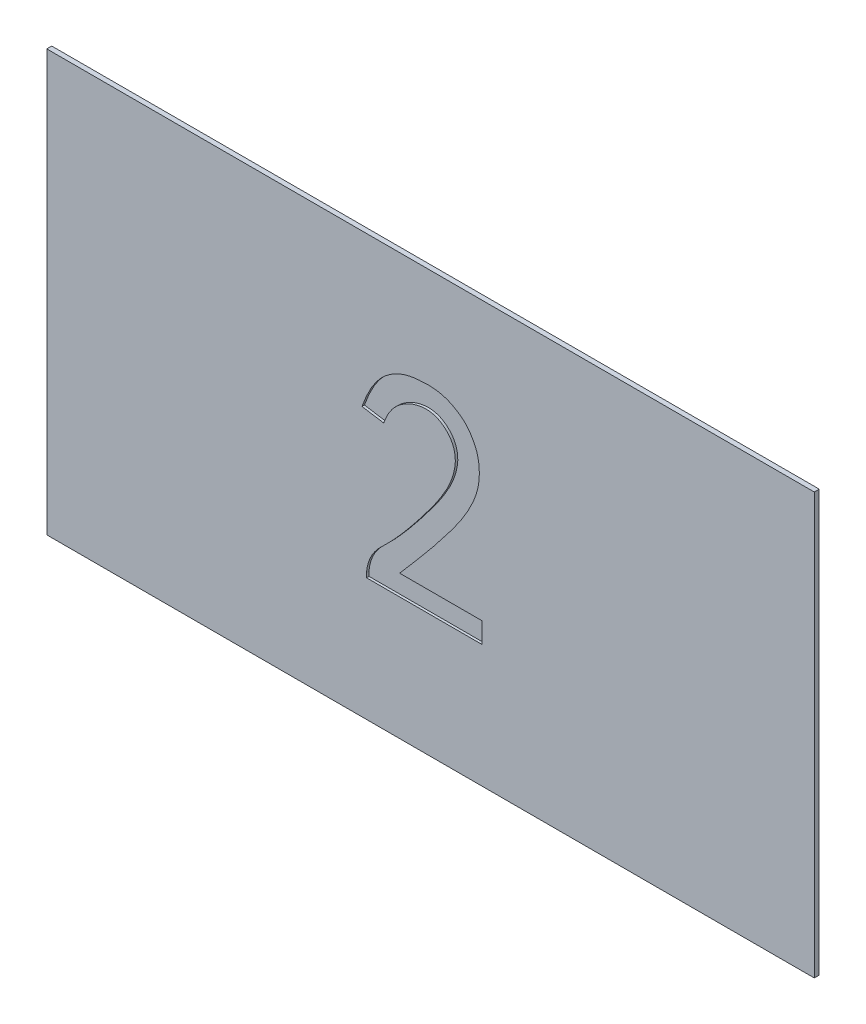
ISO-10303-21;
HEADER;
FILE_DESCRIPTION(('STEP AP214'),'2;1');
FILE_NAME('part.step','',(''),(''),'','','');
FILE_SCHEMA(('AUTOMOTIVE_DESIGN { 1 0 10303 214 1 1 1 1 }'));
ENDSEC;
DATA;
#1=APPLICATION_CONTEXT('core data for automotive mechanical design processes');
#2=APPLICATION_PROTOCOL_DEFINITION('international standard','automotive_design',2000,#1);
#3=PRODUCT_CONTEXT('',#1,'mechanical');
#4=PRODUCT('Part','Part','',(#3));
#5=PRODUCT_RELATED_PRODUCT_CATEGORY('part','',(#4));
#6=PRODUCT_DEFINITION_FORMATION('','',#4);
#7=PRODUCT_DEFINITION_CONTEXT('part definition',#1,'design');
#8=PRODUCT_DEFINITION('design','',#6,#7);
#9=PRODUCT_DEFINITION_SHAPE('','',#8);
#10=(LENGTH_UNIT() NAMED_UNIT(*) SI_UNIT(.MILLI.,.METRE.));
#11=(NAMED_UNIT(*) PLANE_ANGLE_UNIT() SI_UNIT($,.RADIAN.));
#12=(NAMED_UNIT(*) SI_UNIT($,.STERADIAN.) SOLID_ANGLE_UNIT());
#13=UNCERTAINTY_MEASURE_WITH_UNIT(LENGTH_MEASURE(1.E-05),#10,'distance_accuracy_value','');
#14=(GEOMETRIC_REPRESENTATION_CONTEXT(3) GLOBAL_UNCERTAINTY_ASSIGNED_CONTEXT((#13)) GLOBAL_UNIT_ASSIGNED_CONTEXT((#10,
#11,#12)) REPRESENTATION_CONTEXT('',''));
#15=CARTESIAN_POINT('',(0.,0.,0.));
#16=DIRECTION('',(0.,0.,1.));
#17=DIRECTION('',(1.,0.,0.));
#18=AXIS2_PLACEMENT_3D('',#15,#16,#17);
#19=CARTESIAN_POINT('',(0.605282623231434,1.08620645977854,0.0999999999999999));
#20=DIRECTION('',(0.,0.,1.));
#21=DIRECTION('',(1.,0.,0.));
#22=AXIS2_PLACEMENT_3D('',#19,#20,#21);
#23=PLANE('',#22);
#24=DIRECTION('',(-0.987762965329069,0.155962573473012,0.));
#25=VECTOR('',#24,1.);
#26=CARTESIAN_POINT('',(-1.89274645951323,2.21837850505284,0.1));
#27=LINE('',#26,#25);
#28=CARTESIAN_POINT('',(-1.89274645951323,2.21837850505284,0.100000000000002));
#29=VERTEX_POINT('',#28);
#30=CARTESIAN_POINT('',(-2.76856628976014,2.35666584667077,0.0999999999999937));
#31=VERTEX_POINT('',#30);
#32=EDGE_CURVE('E130',#29,#31,#27,.T.);
#33=ORIENTED_EDGE('',*,*,#32,.F.);
#34=CARTESIAN_POINT('',(-2.5841831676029,-3.35921094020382,0.100000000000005));
#35=CARTESIAN_POINT('',(-2.58256671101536,-3.34264158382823,0.0999999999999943));
#36=CARTESIAN_POINT('',(-2.58094761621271,-3.32607082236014,0.0999999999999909));
#37=CARTESIAN_POINT('',(-2.57752370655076,-3.29293969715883,0.0999999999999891));
#38=CARTESIAN_POINT('',(-2.57571879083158,-3.27637934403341,0.0999999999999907));
#39=CARTESIAN_POINT('',(-2.57173825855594,-3.24325119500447,0.0999999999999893));
#40=CARTESIAN_POINT('',(-2.56956155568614,-3.22668352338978,0.0999999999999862));
#41=CARTESIAN_POINT('',(-2.56462840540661,-3.19363751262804,0.0999999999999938));
#42=CARTESIAN_POINT('',(-2.56187209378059,-3.17715915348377,0.100000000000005));
#43=CARTESIAN_POINT('',(-2.55020208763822,-3.11460527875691,0.100000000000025));
#44=CARTESIAN_POINT('',(-2.53917058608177,-3.06892087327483,0.0999999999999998));
#45=CARTESIAN_POINT('',(-2.51357560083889,-2.97851326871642,0.0999999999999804));
#46=CARTESIAN_POINT('',(-2.49900707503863,-2.93379154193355,0.0999999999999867));
#47=CARTESIAN_POINT('',(-2.46623843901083,-2.84575001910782,0.0999999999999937));
#48=CARTESIAN_POINT('',(-2.44804323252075,-2.80242842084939,0.0999999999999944));
#49=CARTESIAN_POINT('',(-2.41824782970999,-2.73866189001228,0.0999999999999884));
#50=CARTESIAN_POINT('',(-2.40790374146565,-2.71761750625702,0.0999999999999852));
#51=CARTESIAN_POINT('',(-2.38641705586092,-2.67593867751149,0.0999999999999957));
#52=CARTESIAN_POINT('',(-2.37527447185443,-2.65530422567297,0.100000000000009));
#53=CARTESIAN_POINT('',(-2.35200078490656,-2.61423770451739,0.10000000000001));
#54=CARTESIAN_POINT('',(-2.33985855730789,-2.59381192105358,0.0999999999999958));
#55=CARTESIAN_POINT('',(-2.31465193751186,-2.55354080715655,0.0999999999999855));
#56=CARTESIAN_POINT('',(-2.30158766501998,-2.53369540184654,0.0999999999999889));
#57=CARTESIAN_POINT('',(-2.26117782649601,-2.47497189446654,0.0999999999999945));
#58=CARTESIAN_POINT('',(-2.23262765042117,-2.43692813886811,0.0999999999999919));
#59=CARTESIAN_POINT('',(-2.18858651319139,-2.38075830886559,0.0999999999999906));
#60=CARTESIAN_POINT('',(-2.17367931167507,-2.3621560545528,0.0999999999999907));
#61=CARTESIAN_POINT('',(-2.14332925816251,-2.32539728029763,0.0999999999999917));
#62=CARTESIAN_POINT('',(-2.12788658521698,-2.30724061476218,0.0999999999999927));
#63=CARTESIAN_POINT('',(-2.09630836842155,-2.2715472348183,0.09999999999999));
#64=CARTESIAN_POINT('',(-2.08017302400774,-2.25401034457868,0.0999999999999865));
#65=CARTESIAN_POINT('',(-2.04721310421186,-2.21959372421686,0.0999999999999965));
#66=CARTESIAN_POINT('',(-2.03038839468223,-2.20271412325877,0.10000000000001));
#67=CARTESIAN_POINT('',(-1.99994725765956,-2.17286323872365,0.100000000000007));
#68=CARTESIAN_POINT('',(-1.98640217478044,-2.15981816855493,0.0999999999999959));
#69=CARTESIAN_POINT('',(-1.95919294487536,-2.13385453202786,0.0999999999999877));
#70=CARTESIAN_POINT('',(-1.94552880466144,-2.12093595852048,0.0999999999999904));
#71=CARTESIAN_POINT('',(-1.9045098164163,-2.08219630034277,0.0999999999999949));
#72=CARTESIAN_POINT('',(-1.87713457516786,-2.05639713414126,0.099999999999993));
#73=CARTESIAN_POINT('',(-1.82273087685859,-2.00443359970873,0.0999999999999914));
#74=CARTESIAN_POINT('',(-1.79570240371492,-1.97826924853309,0.0999999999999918));
#75=CARTESIAN_POINT('',(-1.74236495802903,-1.92533632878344,0.099999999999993));
#76=CARTESIAN_POINT('',(-1.71605450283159,-1.89856925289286,0.0999999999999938));
#77=CARTESIAN_POINT('',(-1.66372640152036,-1.84473904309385,0.0999999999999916));
#78=CARTESIAN_POINT('',(-1.63770884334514,-1.81767582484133,0.0999999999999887));
#79=CARTESIAN_POINT('',(-1.5857253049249,-1.76349869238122,0.0999999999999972));
#80=CARTESIAN_POINT('',(-1.55975932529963,-1.73638477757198,0.100000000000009));
#81=CARTESIAN_POINT('',(-1.51452988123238,-1.68870593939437,0.100000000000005));
#82=CARTESIAN_POINT('',(-1.49521019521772,-1.66819451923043,0.0999999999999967));
#83=CARTESIAN_POINT('',(-1.45681011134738,-1.62694912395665,0.0999999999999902));
#84=CARTESIAN_POINT('',(-1.43772970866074,-1.60621515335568,0.0999999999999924));
#85=CARTESIAN_POINT('',(-1.38086681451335,-1.54367848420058,0.099999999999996));
#86=CARTESIAN_POINT('',(-1.34345852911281,-1.50153672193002,0.099999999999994));
#87=CARTESIAN_POINT('',(-1.28751720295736,-1.43813307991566,0.0999999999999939));
#88=CARTESIAN_POINT('',(-1.26888775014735,-1.4169542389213,0.0999999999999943));
#89=CARTESIAN_POINT('',(-1.23162878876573,-1.37459667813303,0.099999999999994));
#90=CARTESIAN_POINT('',(-1.21299928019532,-1.35341795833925,0.0999999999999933));
#91=CARTESIAN_POINT('',(-1.15719305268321,-1.28980792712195,0.0999999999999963));
#92=CARTESIAN_POINT('',(-1.12009901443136,-1.24730317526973,0.100000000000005));
#93=CARTESIAN_POINT('',(-1.04663342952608,-1.16172199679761,0.100000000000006));
#94=CARTESIAN_POINT('',(-1.01026141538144,-1.11864597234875,0.0999999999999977));
#95=CARTESIAN_POINT('',(-0.938034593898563,-1.0320638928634,0.0999999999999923));
#96=CARTESIAN_POINT('',(-0.902179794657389,-0.98855783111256,0.099999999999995));
#97=CARTESIAN_POINT('',(-0.830658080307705,-0.901421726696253,0.0999999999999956));
#98=CARTESIAN_POINT('',(-0.794991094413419,-0.85779174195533,0.0999999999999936));
#99=CARTESIAN_POINT('',(-0.723853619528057,-0.770372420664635,0.0999999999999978));
#100=CARTESIAN_POINT('',(-0.688383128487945,-0.726583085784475,0.100000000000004));
#101=CARTESIAN_POINT('',(-0.617675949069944,-0.638814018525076,0.100000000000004));
#102=CARTESIAN_POINT('',(-0.582439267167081,-0.594834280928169,0.0999999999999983));
#103=CARTESIAN_POINT('',(-0.512209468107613,-0.506680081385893,0.0999999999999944));
#104=CARTESIAN_POINT('',(-0.47721635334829,-0.462505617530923,0.0999999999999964));
#105=CARTESIAN_POINT('',(-0.407466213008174,-0.373965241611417,0.099999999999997));
#106=CARTESIAN_POINT('',(-0.372709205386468,-0.3295993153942,0.0999999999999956));
#107=CARTESIAN_POINT('',(-0.303532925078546,-0.240605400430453,0.0999999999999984));
#108=CARTESIAN_POINT('',(-0.269113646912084,-0.195977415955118,0.100000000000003));
#109=CARTESIAN_POINT('',(-0.200774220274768,-0.106336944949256,0.100000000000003));
#110=CARTESIAN_POINT('',(-0.166854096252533,-0.0613244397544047,0.099999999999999));
#111=CARTESIAN_POINT('',(-0.0994923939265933,0.0290569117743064,0.0999999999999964));
#112=CARTESIAN_POINT('',(-0.0660508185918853,0.0744257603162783,0.0999999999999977));
#113=CARTESIAN_POINT('',(0.000521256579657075,0.165396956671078,0.0999999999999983));
#114=CARTESIAN_POINT('',(0.0336517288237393,0.21099932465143,0.0999999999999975));
#115=CARTESIAN_POINT('',(0.0995378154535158,0.30247771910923,0.099999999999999));
#116=CARTESIAN_POINT('',(0.132293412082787,0.348353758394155,0.100000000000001));
#117=CARTESIAN_POINT('',(0.197338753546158,0.44050336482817,0.100000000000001));
#118=CARTESIAN_POINT('',(0.229628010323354,0.486777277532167,0.0999999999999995));
#119=CARTESIAN_POINT('',(0.293304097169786,0.579942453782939,0.0999999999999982));
#120=CARTESIAN_POINT('',(0.324690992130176,0.626833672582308,0.0999999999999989));
#121=CARTESIAN_POINT('',(0.386138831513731,0.721449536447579,0.0999999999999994));
#122=CARTESIAN_POINT('',(0.416200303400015,0.769173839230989,0.0999999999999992));
#123=CARTESIAN_POINT('',(0.475411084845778,0.865185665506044,0.0999999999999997));
#124=CARTESIAN_POINT('',(0.504560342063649,0.913473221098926,0.1));
#125=CARTESIAN_POINT('',(0.554446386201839,0.997879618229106,0.1));
#126=CARTESIAN_POINT('',(0.575388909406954,1.03387697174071,0.1));
#127=CARTESIAN_POINT('',(0.616732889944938,1.10617502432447,0.0999999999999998));
#128=CARTESIAN_POINT('',(0.637134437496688,1.1424756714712,0.0999999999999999));
#129=CARTESIAN_POINT('',(0.676791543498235,1.21577948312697,0.1));
#130=CARTESIAN_POINT('',(0.696045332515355,1.25278362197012,0.1));
#131=CARTESIAN_POINT('',(0.732832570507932,1.32763868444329,0.1));
#132=CARTESIAN_POINT('',(0.750365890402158,1.36548967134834,0.0999999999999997));
#133=CARTESIAN_POINT('',(0.793050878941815,1.46201185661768,0.0999999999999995));
#134=CARTESIAN_POINT('',(0.817311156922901,1.52107837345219,0.1));
#135=CARTESIAN_POINT('',(0.862400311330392,1.64054865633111,0.100000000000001));
#136=CARTESIAN_POINT('',(0.883227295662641,1.70095313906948,0.100000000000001));
#137=CARTESIAN_POINT('',(0.920850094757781,1.82294614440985,0.100000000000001));
#138=CARTESIAN_POINT('',(0.937651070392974,1.88453304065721,0.100000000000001));
#139=CARTESIAN_POINT('',(0.95911792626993,1.97774815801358,0.100000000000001));
#140=CARTESIAN_POINT('',(0.965649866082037,2.00895056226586,0.100000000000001));
#141=CARTESIAN_POINT('',(0.977342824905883,2.07160906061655,0.1));
#142=CARTESIAN_POINT('',(0.982504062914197,2.10306511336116,0.0999999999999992));
#143=CARTESIAN_POINT('',(0.991863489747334,2.17126634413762,0.099999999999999));
#144=CARTESIAN_POINT('',(0.995775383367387,2.2080523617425,0.1));
#145=CARTESIAN_POINT('',(1.00085690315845,2.28181103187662,0.100000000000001));
#146=CARTESIAN_POINT('',(1.00202741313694,2.31878362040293,0.100000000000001));
#147=CARTESIAN_POINT('',(1.0013750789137,2.39265274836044,0.100000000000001));
#148=CARTESIAN_POINT('',(0.999556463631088,2.42954932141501,0.100000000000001));
#149=CARTESIAN_POINT('',(0.992923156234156,2.50308670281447,0.1));
#150=CARTESIAN_POINT('',(0.988107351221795,2.53972741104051,0.0999999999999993));
#151=CARTESIAN_POINT('',(0.975323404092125,2.61281578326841,0.0999999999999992));
#152=CARTESIAN_POINT('',(0.967326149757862,2.64925842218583,0.1));
#153=CARTESIAN_POINT('',(0.94797804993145,2.72123623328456,0.100000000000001));
#154=CARTESIAN_POINT('',(0.936628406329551,2.75677172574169,0.100000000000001));
#155=CARTESIAN_POINT('',(0.910513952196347,2.82654266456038,0.1));
#156=CARTESIAN_POINT('',(0.895751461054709,2.86077897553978,0.1));
#157=CARTESIAN_POINT('',(0.863027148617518,2.92767827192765,0.1));
#158=CARTESIAN_POINT('',(0.845064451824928,2.96034082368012,0.1));
#159=CARTESIAN_POINT('',(0.790746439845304,3.04873051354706,0.0999999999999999));
#160=CARTESIAN_POINT('',(0.751013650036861,3.10245985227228,0.1));
#161=CARTESIAN_POINT('',(0.684887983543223,3.17721379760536,0.0999999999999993));
#162=CARTESIAN_POINT('',(0.661720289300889,3.20118870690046,0.0999999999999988));
#163=CARTESIAN_POINT('',(0.613560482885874,3.24726851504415,0.0999999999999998));
#164=CARTESIAN_POINT('',(0.588567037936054,3.26937202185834,0.100000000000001));
#165=CARTESIAN_POINT('',(0.536631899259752,3.3121941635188,0.100000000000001));
#166=CARTESIAN_POINT('',(0.50966243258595,3.33287899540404,0.0999999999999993));
#167=CARTESIAN_POINT('',(0.454206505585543,3.37208474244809,0.0999999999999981));
#168=CARTESIAN_POINT('',(0.425721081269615,3.39060710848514,0.0999999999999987));
#169=CARTESIAN_POINT('',(0.367276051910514,3.4249579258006,0.099999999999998));
#170=CARTESIAN_POINT('',(0.337321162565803,3.44079434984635,0.0999999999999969));
#171=CARTESIAN_POINT('',(0.27606137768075,3.46962447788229,0.0999999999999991));
#172=CARTESIAN_POINT('',(0.244755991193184,3.48261713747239,0.100000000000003));
#173=CARTESIAN_POINT('',(0.181299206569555,3.50565442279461,0.100000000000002));
#174=CARTESIAN_POINT('',(0.149154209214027,3.51571671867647,0.0999999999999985));
#175=CARTESIAN_POINT('',(0.0840988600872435,3.53292252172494,0.0999999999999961));
#176=CARTESIAN_POINT('',(0.0511886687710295,3.54006663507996,0.0999999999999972));
#177=CARTESIAN_POINT('',(-0.015223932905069,3.55135420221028,0.0999999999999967));
#178=CARTESIAN_POINT('',(-0.0487275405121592,3.55549065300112,0.099999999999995));
#179=CARTESIAN_POINT('',(-0.115964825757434,3.5606924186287,0.0999999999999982));
#180=CARTESIAN_POINT('',(-0.149698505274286,3.56175770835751,0.100000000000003));
#181=CARTESIAN_POINT('',(-0.227966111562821,3.56112860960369,0.100000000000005));
#182=CARTESIAN_POINT('',(-0.272489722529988,3.55843820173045,0.0999999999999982));
#183=CARTESIAN_POINT('',(-0.361140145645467,3.54917206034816,0.0999999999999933));
#184=CARTESIAN_POINT('',(-0.405266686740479,3.54259385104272,0.0999999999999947));
#185=CARTESIAN_POINT('',(-0.471022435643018,3.5301898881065,0.0999999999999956));
#186=CARTESIAN_POINT('',(-0.4928985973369,3.52562438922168,0.0999999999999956));
#187=CARTESIAN_POINT('',(-0.536477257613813,3.51572770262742,0.0999999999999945));
#188=CARTESIAN_POINT('',(-0.558179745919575,3.51039646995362,0.0999999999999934));
#189=CARTESIAN_POINT('',(-0.622937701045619,3.49326202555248,0.0999999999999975));
#190=CARTESIAN_POINT('',(-0.66570079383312,3.48030721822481,0.10000000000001));
#191=CARTESIAN_POINT('',(-0.729488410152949,3.45810548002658,0.100000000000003));
#192=CARTESIAN_POINT('',(-0.750959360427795,3.45012447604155,0.0999999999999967));
#193=CARTESIAN_POINT('',(-0.793523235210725,3.43321255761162,0.0999999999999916));
#194=CARTESIAN_POINT('',(-0.814616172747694,3.42428167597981,0.0999999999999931));
#195=CARTESIAN_POINT('',(-0.877362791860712,3.39621355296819,0.0999999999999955));
#196=CARTESIAN_POINT('',(-0.9184531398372,3.37581186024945,0.0999999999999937));
#197=CARTESIAN_POINT('',(-0.979022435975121,3.34340547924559,0.0999999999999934));
#198=CARTESIAN_POINT('',(-0.99900770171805,3.33231921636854,0.0999999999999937));
#199=CARTESIAN_POINT('',(-1.038665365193,3.30960032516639,0.0999999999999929));
#200=CARTESIAN_POINT('',(-1.05833777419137,3.29796771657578,0.099999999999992));
#201=CARTESIAN_POINT('',(-1.11677974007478,3.26216159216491,0.0999999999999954));
#202=CARTESIAN_POINT('',(-1.15499569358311,3.23706830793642,0.100000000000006));
#203=CARTESIAN_POINT('',(-1.23647083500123,3.17891783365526,0.100000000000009));
#204=CARTESIAN_POINT('',(-1.27930170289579,3.14525452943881,0.0999999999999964));
#205=CARTESIAN_POINT('',(-1.36151140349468,3.07392804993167,0.0999999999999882));
#206=CARTESIAN_POINT('',(-1.40088949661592,3.03626402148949,0.0999999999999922));
#207=CARTESIAN_POINT('',(-1.47589191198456,2.95717911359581,0.0999999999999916));
#208=CARTESIAN_POINT('',(-1.51150562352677,2.91574819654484,0.0999999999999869));
#209=CARTESIAN_POINT('',(-1.57886870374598,2.82988394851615,0.0999999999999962));
#210=CARTESIAN_POINT('',(-1.61061869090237,2.78545109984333,0.10000000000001));
#211=CARTESIAN_POINT('',(-1.66698682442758,2.69917055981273,0.100000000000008));
#212=CARTESIAN_POINT('',(-1.69200541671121,2.65758365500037,0.0999999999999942));
#213=CARTESIAN_POINT('',(-1.72725508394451,2.59393964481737,0.0999999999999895));
#214=CARTESIAN_POINT('',(-1.7386284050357,2.57250760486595,0.0999999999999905));
#215=CARTESIAN_POINT('',(-1.76059631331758,2.52924768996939,0.0999999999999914));
#216=CARTESIAN_POINT('',(-1.77119093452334,2.5074198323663,0.0999999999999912));
#217=CARTESIAN_POINT('',(-1.80183162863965,2.44168746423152,0.0999999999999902));
#218=CARTESIAN_POINT('',(-1.8208544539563,2.39731394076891,0.0999999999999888));
#219=CARTESIAN_POINT('',(-1.85749982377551,2.30806732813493,0.0999999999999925));
#220=CARTESIAN_POINT('',(-1.87512456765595,2.2631951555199,0.0999999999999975));
#221=CARTESIAN_POINT('',(-1.89274645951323,2.21837850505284,0.100000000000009));
#222=B_SPLINE_CURVE_WITH_KNOTS('',3,(#34,#35,#36,#37,#38,#39,#40,#41,#42,#43,#44,#45,#46,#47,
#48,#49,#50,#51,#52,#53,#54,#55,#56,#57,#58,#59,#60,#61,#62,#63,#64,#65,#66,#67,#68,#69,#70,#71,
#72,#73,#74,#75,#76,#77,#78,#79,#80,#81,#82,#83,#84,#85,#86,#87,#88,#89,#90,#91,#92,#93,#94,#95,
#96,#97,#98,#99,#100,#101,#102,#103,#104,#105,#106,#107,#108,#109,#110,#111,#112,#113,#114,#115,
#116,#117,#118,#119,#120,#121,#122,#123,#124,#125,#126,#127,#128,#129,#130,#131,#132,#133,#134,
#135,#136,#137,#138,#139,#140,#141,#142,#143,#144,#145,#146,#147,#148,#149,#150,#151,#152,#153,
#154,#155,#156,#157,#158,#159,#160,#161,#162,#163,#164,#165,#166,#167,#168,#169,#170,#171,#172,
#173,#174,#175,#176,#177,#178,#179,#180,#181,#182,#183,#184,#185,#186,#187,#188,#189,#190,#191,
#192,#193,#194,#195,#196,#197,#198,#199,#200,#201,#202,#203,#204,#205,#206,#207,#208,#209,#210,
#211,#212,#213,#214,#215,#216,#217,#218,#219,#220,#221),.UNSPECIFIED.,.F.,.F.,(4,2,2,2,2,2,2,2,
2,2,2,2,2,2,2,2,2,2,2,2,2,2,2,2,2,2,2,2,2,2,2,2,2,2,2,2,2,2,2,2,2,2,2,2,2,2,2,2,2,2,2,2,2,2,2,2,
2,2,2,2,2,2,2,2,2,2,2,2,2,2,2,2,2,2,2,2,2,2,2,2,2,2,2,2,2,2,2,2,2,2,2,2,2,4),(0.,
0.0499467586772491,0.0999207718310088,0.150043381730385,0.200154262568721,0.340927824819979,
0.481903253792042,0.622689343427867,0.693024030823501,0.763357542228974,0.834621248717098,
0.905875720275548,1.04845922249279,1.1199741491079,1.19146538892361,1.26293618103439,
1.33442094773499,1.39083641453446,1.44724867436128,1.56009872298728,1.67294351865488,
1.7855342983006,1.89815802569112,2.01078309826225,2.09531420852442,2.17984360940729,
2.34888456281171,2.43350422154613,2.51812331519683,2.68736323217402,2.85648973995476,
3.02561889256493,3.19467893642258,3.36373721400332,3.53280015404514,3.70186475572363,
3.87094207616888,4.04001664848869,4.20909947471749,4.37818334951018,4.54728208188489,
4.71638879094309,4.88566124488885,5.05492149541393,5.22411376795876,5.39331573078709,
5.51825076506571,5.64316483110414,5.76826673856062,5.89337802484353,6.08484396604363,
6.27641507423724,6.46773928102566,6.56335041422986,6.65894626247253,6.76984035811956,
6.88069869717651,6.99140033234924,7.10214309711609,7.21392343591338,7.3256637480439,
7.43732834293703,7.54902353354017,7.74830442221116,7.8482328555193,7.94823497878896,
8.05011511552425,8.1519264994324,8.25343017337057,8.35497106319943,8.45588634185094,
8.55678064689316,8.65790912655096,8.75903843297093,8.89264182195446,9.0263303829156,
9.09336013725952,9.16039382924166,9.29428708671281,9.36298659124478,9.43168372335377,
9.5691767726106,9.63773470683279,9.70629016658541,9.84332768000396,10.0065023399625,
10.1697118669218,10.3333698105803,10.4970015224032,10.6424637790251,10.7152395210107,
10.7880120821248,10.932806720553,11.0773688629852),.UNSPECIFIED.);
#223=CARTESIAN_POINT('',(-2.5841831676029,-3.35921094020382,0.099999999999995));
#224=VERTEX_POINT('',#223);
#225=EDGE_CURVE('E24',#224,#29,#222,.T.);
#226=ORIENTED_EDGE('',*,*,#225,.F.);
#227=DIRECTION('',(0.,1.,0.));
#228=VECTOR('',#227,1.);
#229=CARTESIAN_POINT('',(-2.5841831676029,-3.54359406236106,0.1));
#230=LINE('',#229,#228);
#231=CARTESIAN_POINT('',(-2.5841831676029,-3.54359406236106,0.1));
#232=VERTEX_POINT('',#231);
#233=EDGE_CURVE('E113',#232,#224,#230,.T.);
#234=ORIENTED_EDGE('',*,*,#233,.F.);
#235=DIRECTION('',(1.,0.,0.));
#236=VECTOR('',#235,1.);
#237=CARTESIAN_POINT('',(2.07149066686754,-3.54359406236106,0.1));
#238=LINE('',#237,#236);
#239=CARTESIAN_POINT('',(2.07149066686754,-3.54359406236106,0.100000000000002));
#240=VERTEX_POINT('',#239);
#241=EDGE_CURVE('E223',#240,#232,#238,.F.);
#242=ORIENTED_EDGE('',*,*,#241,.F.);
#243=DIRECTION('',(0.,1.,0.));
#244=VECTOR('',#243,1.);
#245=CARTESIAN_POINT('',(2.07149066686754,1.08620645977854,0.100000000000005));
#246=LINE('',#245,#244);
#247=CARTESIAN_POINT('',(2.07149066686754,-2.71387001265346,0.100000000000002));
#248=VERTEX_POINT('',#247);
#249=EDGE_CURVE('E236',#240,#248,#246,.T.);
#250=ORIENTED_EDGE('',*,*,#249,.T.);
#251=DIRECTION('',(1.,0.,0.));
#252=VECTOR('',#251,1.);
#253=CARTESIAN_POINT('',(-1.24740553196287,-2.71387001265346,0.1));
#254=LINE('',#253,#252);
#255=CARTESIAN_POINT('',(-1.24740553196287,-2.71387001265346,0.100000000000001));
#256=VERTEX_POINT('',#255);
#257=EDGE_CURVE('E239',#256,#248,#254,.T.);
#258=ORIENTED_EDGE('',*,*,#257,.F.);
#259=CARTESIAN_POINT('',(-0.46377726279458,4.43097597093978,0.100000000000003));
#260=CARTESIAN_POINT('',(-0.447192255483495,4.43230583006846,0.0999999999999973));
#261=CARTESIAN_POINT('',(-0.430607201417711,4.43363617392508,0.0999999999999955));
#262=CARTESIAN_POINT('',(-0.397431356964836,4.43623887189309,0.0999999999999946));
#263=CARTESIAN_POINT('',(-0.380840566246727,4.43751122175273,0.0999999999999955));
#264=CARTESIAN_POINT('',(-0.347592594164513,4.4399429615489,0.0999999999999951));
#265=CARTESIAN_POINT('',(-0.330935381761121,4.44110194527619,0.0999999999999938));
#266=CARTESIAN_POINT('',(-0.297610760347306,4.44324763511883,0.099999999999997));
#267=CARTESIAN_POINT('',(-0.280943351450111,4.4442343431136,0.100000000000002));
#268=CARTESIAN_POINT('',(-0.196616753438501,4.44859501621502,0.100000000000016));
#269=CARTESIAN_POINT('',(-0.128828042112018,4.45004641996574,0.0999999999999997));
#270=CARTESIAN_POINT('',(-0.0271910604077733,4.44832822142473,0.0999999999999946));
#271=CARTESIAN_POINT('',(0.00669801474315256,4.44710460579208,0.0999999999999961));
#272=CARTESIAN_POINT('',(0.0744116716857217,4.44336789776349,0.0999999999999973));
#273=CARTESIAN_POINT('',(0.108236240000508,4.44085456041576,0.0999999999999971));
#274=CARTESIAN_POINT('',(0.175766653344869,4.43467067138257,0.099999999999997));
#275=CARTESIAN_POINT('',(0.209472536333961,4.43100053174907,0.0999999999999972));
#276=CARTESIAN_POINT('',(0.276703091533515,4.42226845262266,0.0999999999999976));
#277=CARTESIAN_POINT('',(0.310227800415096,4.41720680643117,0.0999999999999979));
#278=CARTESIAN_POINT('',(0.376894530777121,4.40524812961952,0.0999999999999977));
#279=CARTESIAN_POINT('',(0.410037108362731,4.39835425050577,0.0999999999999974));
#280=CARTESIAN_POINT('',(0.475878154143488,4.38270644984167,0.099999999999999));
#281=CARTESIAN_POINT('',(0.508576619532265,4.37395251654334,0.100000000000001));
#282=CARTESIAN_POINT('',(0.584634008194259,4.35131340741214,0.100000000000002));
#283=CARTESIAN_POINT('',(0.627777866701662,4.33669996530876,0.0999999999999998));
#284=CARTESIAN_POINT('',(0.71297028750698,4.30440339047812,0.0999999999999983));
#285=CARTESIAN_POINT('',(0.755017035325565,4.28671550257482,0.0999999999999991));
#286=CARTESIAN_POINT('',(0.837948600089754,4.24864523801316,0.0999999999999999));
#287=CARTESIAN_POINT('',(0.878831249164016,4.22825818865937,0.0999999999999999));
#288=CARTESIAN_POINT('',(0.959421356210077,4.18547375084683,0.1));
#289=CARTESIAN_POINT('',(0.999130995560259,4.16308045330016,0.1));
#290=CARTESIAN_POINT('',(1.07720174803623,4.11616397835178,0.100000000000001));
#291=CARTESIAN_POINT('',(1.11556465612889,4.0916437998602,0.100000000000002));
#292=CARTESIAN_POINT('',(1.19061197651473,4.04023638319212,0.1));
#293=CARTESIAN_POINT('',(1.22729877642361,4.01335268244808,0.0999999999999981));
#294=CARTESIAN_POINT('',(1.28593399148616,3.9664718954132,0.0999999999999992));
#295=CARTESIAN_POINT('',(1.30856766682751,3.94733484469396,0.100000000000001));
#296=CARTESIAN_POINT('',(1.35264247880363,3.9077378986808,0.100000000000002));
#297=CARTESIAN_POINT('',(1.37408365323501,3.88727804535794,0.100000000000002));
#298=CARTESIAN_POINT('',(1.43663704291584,3.82414587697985,0.100000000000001));
#299=CARTESIAN_POINT('',(1.47598884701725,3.77971311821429,0.0999999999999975));
#300=CARTESIAN_POINT('',(1.55045855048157,3.68678761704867,0.099999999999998));
#301=CARTESIAN_POINT('',(1.58553224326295,3.63826003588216,0.100000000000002));
#302=CARTESIAN_POINT('',(1.63533201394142,3.56359045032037,0.100000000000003));
#303=CARTESIAN_POINT('',(1.65147302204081,3.53837060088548,0.100000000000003));
#304=CARTESIAN_POINT('',(1.6828083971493,3.48734976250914,0.100000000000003));
#305=CARTESIAN_POINT('',(1.69800282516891,3.46154881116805,0.100000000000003));
#306=CARTESIAN_POINT('',(1.74203561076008,3.38331371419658,0.100000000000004));
#307=CARTESIAN_POINT('',(1.76934881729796,3.3300095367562,0.100000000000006));
#308=CARTESIAN_POINT('',(1.81926276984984,3.22125097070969,0.100000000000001));
#309=CARTESIAN_POINT('',(1.84186669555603,3.16579806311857,0.0999999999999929));
#310=CARTESIAN_POINT('',(1.87131246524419,3.08157700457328,0.099999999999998));
#311=CARTESIAN_POINT('',(1.88032869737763,3.05356129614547,0.100000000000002));
#312=CARTESIAN_POINT('',(1.89692312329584,2.99710419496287,0.100000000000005));
#313=CARTESIAN_POINT('',(1.90450120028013,2.96866276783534,0.100000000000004));
#314=CARTESIAN_POINT('',(1.91831782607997,2.91144568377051,0.100000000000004));
#315=CARTESIAN_POINT('',(1.92455582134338,2.8826698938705,0.100000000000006));
#316=CARTESIAN_POINT('',(1.9357616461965,2.82487762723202,0.100000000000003));
#317=CARTESIAN_POINT('',(1.94072955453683,2.79586116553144,0.099999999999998));
#318=CARTESIAN_POINT('',(1.95616770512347,2.69308651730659,0.0999999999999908));
#319=CARTESIAN_POINT('',(1.96342193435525,2.61882177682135,0.100000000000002));
#320=CARTESIAN_POINT('',(1.96938559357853,2.50715918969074,0.100000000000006));
#321=CARTESIAN_POINT('',(1.97055254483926,2.46985609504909,0.100000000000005));
#322=CARTESIAN_POINT('',(1.97137336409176,2.39523329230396,0.100000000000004));
#323=CARTESIAN_POINT('',(1.97102742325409,2.35791358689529,0.100000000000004));
#324=CARTESIAN_POINT('',(1.96886665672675,2.28331375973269,0.100000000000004));
#325=CARTESIAN_POINT('',(1.96705164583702,2.24603364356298,0.100000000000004));
#326=CARTESIAN_POINT('',(1.96201135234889,2.17156378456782,0.100000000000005));
#327=CARTESIAN_POINT('',(1.95878581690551,2.13437405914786,0.100000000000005));
#328=CARTESIAN_POINT('',(1.95096472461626,2.06019989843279,0.100000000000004));
#329=CARTESIAN_POINT('',(1.94637158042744,2.02321521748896,0.100000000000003));
#330=CARTESIAN_POINT('',(1.93810645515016,1.96794884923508,0.100000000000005));
#331=CARTESIAN_POINT('',(1.93512272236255,1.94956454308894,0.100000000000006));
#332=CARTESIAN_POINT('',(1.92863411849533,1.91288824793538,0.100000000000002));
#333=CARTESIAN_POINT('',(1.92512924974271,1.89459625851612,0.0999999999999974));
#334=CARTESIAN_POINT('',(1.91427286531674,1.84185874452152,0.0999999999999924));
#335=CARTESIAN_POINT('',(1.90627676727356,1.80754435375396,0.100000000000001));
#336=CARTESIAN_POINT('',(1.8886878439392,1.73931928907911,0.100000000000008));
#337=CARTESIAN_POINT('',(1.87909441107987,1.70540877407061,0.100000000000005));
#338=CARTESIAN_POINT('',(1.85868051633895,1.63800442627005,0.100000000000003));
#339=CARTESIAN_POINT('',(1.84786139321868,1.60451018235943,0.100000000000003));
#340=CARTESIAN_POINT('',(1.83108758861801,1.5544580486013,0.100000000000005));
#341=CARTESIAN_POINT('',(1.82540592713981,1.5378068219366,0.100000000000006));
#342=CARTESIAN_POINT('',(1.81390298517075,1.50455140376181,0.100000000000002));
#343=CARTESIAN_POINT('',(1.80808169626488,1.48794721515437,0.0999999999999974));
#344=CARTESIAN_POINT('',(1.79176542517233,1.4422502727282,0.0999999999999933));
#345=CARTESIAN_POINT('',(1.78107131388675,1.41322777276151,0.100000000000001));
#346=CARTESIAN_POINT('',(1.75881445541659,1.35552087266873,0.100000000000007));
#347=CARTESIAN_POINT('',(1.74725187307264,1.32683640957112,0.100000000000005));
#348=CARTESIAN_POINT('',(1.7231230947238,1.26989047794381,0.100000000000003));
#349=CARTESIAN_POINT('',(1.71055679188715,1.24162905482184,0.100000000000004));
#350=CARTESIAN_POINT('',(1.68475461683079,1.1854066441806,0.100000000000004));
#351=CARTESIAN_POINT('',(1.67151853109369,1.15744575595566,0.100000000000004));
#352=CARTESIAN_POINT('',(1.64468783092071,1.10168083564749,0.100000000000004));
#353=CARTESIAN_POINT('',(1.63109304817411,1.07387688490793,0.100000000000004));
#354=CARTESIAN_POINT('',(1.60355653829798,1.01844115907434,0.100000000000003));
#355=CARTESIAN_POINT('',(1.58961481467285,0.990809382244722,0.100000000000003));
#356=CARTESIAN_POINT('',(1.56124426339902,0.93580443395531,0.100000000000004));
#357=CARTESIAN_POINT('',(1.54681555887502,0.908431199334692,0.100000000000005));
#358=CARTESIAN_POINT('',(1.51735191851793,0.854013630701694,0.100000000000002));
#359=CARTESIAN_POINT('',(1.50231699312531,0.826969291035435,0.0999999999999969));
#360=CARTESIAN_POINT('',(1.4718373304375,0.77326785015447,0.0999999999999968));
#361=CARTESIAN_POINT('',(1.4563946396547,0.746609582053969,0.100000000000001));
#362=CARTESIAN_POINT('',(1.4251820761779,0.693482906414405,0.100000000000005));
#363=CARTESIAN_POINT('',(1.40941217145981,0.667014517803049,0.100000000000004));
#364=CARTESIAN_POINT('',(1.36181820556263,0.587785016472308,0.100000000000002));
#365=CARTESIAN_POINT('',(1.32970697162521,0.535194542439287,0.100000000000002));
#366=CARTESIAN_POINT('',(1.28053993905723,0.456948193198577,0.100000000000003));
#367=CARTESIAN_POINT('',(1.26398718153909,0.430977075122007,0.100000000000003));
#368=CARTESIAN_POINT('',(1.23046310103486,0.379305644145,0.100000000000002));
#369=CARTESIAN_POINT('',(1.21349176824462,0.353605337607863,0.100000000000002));
#370=CARTESIAN_POINT('',(1.17926347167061,0.302395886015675,0.100000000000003));
#371=CARTESIAN_POINT('',(1.16200650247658,0.27688674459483,0.100000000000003));
#372=CARTESIAN_POINT('',(1.12732537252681,0.225982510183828,0.100000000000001));
#373=CARTESIAN_POINT('',(1.10990121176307,0.200587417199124,0.0999999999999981));
#374=CARTESIAN_POINT('',(1.07491993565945,0.149925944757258,0.099999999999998));
#375=CARTESIAN_POINT('',(1.05736296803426,0.124659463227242,0.100000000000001));
#376=CARTESIAN_POINT('',(1.02206602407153,0.0742571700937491,0.100000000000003));
#377=CARTESIAN_POINT('',(1.00432606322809,0.0491213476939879,0.100000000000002));
#378=CARTESIAN_POINT('',(0.968476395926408,-0.000885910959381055,0.100000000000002));
#379=CARTESIAN_POINT('',(0.950366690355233,-0.0257573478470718,0.100000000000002));
#380=CARTESIAN_POINT('',(0.913815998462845,-0.0752571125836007,0.100000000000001));
#381=CARTESIAN_POINT('',(0.895374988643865,-0.0998854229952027,0.0999999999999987));
#382=CARTESIAN_POINT('',(0.858453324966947,-0.149104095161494,0.0999999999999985));
#383=CARTESIAN_POINT('',(0.839972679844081,-0.173694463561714,0.1));
#384=CARTESIAN_POINT('',(0.803067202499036,-0.222917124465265,0.100000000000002));
#385=CARTESIAN_POINT('',(0.784642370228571,-0.247549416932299,0.100000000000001));
#386=CARTESIAN_POINT('',(0.747745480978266,-0.296776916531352,0.100000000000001));
#387=CARTESIAN_POINT('',(0.729273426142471,-0.321372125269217,0.100000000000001));
#388=CARTESIAN_POINT('',(0.692222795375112,-0.370482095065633,0.100000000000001));
#389=CARTESIAN_POINT('',(0.673644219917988,-0.39499685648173,0.100000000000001));
#390=CARTESIAN_POINT('',(0.636356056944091,-0.443929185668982,0.100000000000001));
#391=CARTESIAN_POINT('',(0.617646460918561,-0.468346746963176,0.100000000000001));
#392=CARTESIAN_POINT('',(0.580062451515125,-0.517054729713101,0.1));
#393=CARTESIAN_POINT('',(0.561188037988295,-0.54134515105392,0.1));
#394=CARTESIAN_POINT('',(0.50439151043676,-0.614082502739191,0.1));
#395=CARTESIAN_POINT('',(0.466296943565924,-0.662394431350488,0.1));
#396=CARTESIAN_POINT('',(0.390002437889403,-0.758926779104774,0.0999999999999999));
#397=CARTESIAN_POINT('',(0.351802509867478,-0.807147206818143,0.0999999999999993));
#398=CARTESIAN_POINT('',(0.275183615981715,-0.90341135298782,0.0999999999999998));
#399=CARTESIAN_POINT('',(0.236764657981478,-0.951455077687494,0.100000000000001));
#400=CARTESIAN_POINT('',(0.159613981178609,-1.04729692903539,0.100000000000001));
#401=CARTESIAN_POINT('',(0.120882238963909,-1.09509503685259,0.0999999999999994));
#402=CARTESIAN_POINT('',(0.0430625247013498,-1.19040060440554,0.0999999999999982));
#403=CARTESIAN_POINT('',(0.00397455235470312,-1.23790806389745,0.0999999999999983));
#404=CARTESIAN_POINT('',(-0.0745316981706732,-1.33265175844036,0.0999999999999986));
#405=CARTESIAN_POINT('',(-0.113949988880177,-1.37988798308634,0.0999999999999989));
#406=CARTESIAN_POINT('',(-0.173097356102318,-1.45072552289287,0.0999999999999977));
#407=CARTESIAN_POINT('',(-0.192816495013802,-1.47433527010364,0.099999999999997));
#408=CARTESIAN_POINT('',(-0.23222364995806,-1.52158071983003,0.0999999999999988));
#409=CARTESIAN_POINT('',(-0.251911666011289,-1.54521642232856,0.100000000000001));
#410=CARTESIAN_POINT('',(-0.311704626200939,-1.61702536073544,0.100000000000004));
#411=CARTESIAN_POINT('',(-0.351795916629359,-1.66520997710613,0.0999999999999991));
#412=CARTESIAN_POINT('',(-0.432148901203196,-1.76143695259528,0.0999999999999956));
#413=CARTESIAN_POINT('',(-0.472410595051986,-1.80947931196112,0.0999999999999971));
#414=CARTESIAN_POINT('',(-0.553112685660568,-1.90541129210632,0.0999999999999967));
#415=CARTESIAN_POINT('',(-0.593553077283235,-1.95330091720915,0.0999999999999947));
#416=CARTESIAN_POINT('',(-0.674617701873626,-2.04892439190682,0.0999999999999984));
#417=CARTESIAN_POINT('',(-0.71524193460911,-2.09665824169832,0.100000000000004));
#418=CARTESIAN_POINT('',(-0.796757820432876,-2.19190681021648,0.100000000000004));
#419=CARTESIAN_POINT('',(-0.837649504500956,-2.23942150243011,0.0999999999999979));
#420=CARTESIAN_POINT('',(-0.919594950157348,-2.3343109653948,0.0999999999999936));
#421=CARTESIAN_POINT('',(-0.960648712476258,-2.38168573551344,0.0999999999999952));
#422=CARTESIAN_POINT('',(-1.04267946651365,-2.47650613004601,0.0999999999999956));
#423=CARTESIAN_POINT('',(-1.08365645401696,-2.52395175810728,0.0999999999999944));
#424=CARTESIAN_POINT('',(-1.16556078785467,-2.61888543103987,0.0999999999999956));
#425=CARTESIAN_POINT('',(-1.20648813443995,-2.66637347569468,0.099999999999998));
#426=CARTESIAN_POINT('',(-1.24740553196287,-2.71387001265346,0.100000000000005));
#427=B_SPLINE_CURVE_WITH_KNOTS('',3,(#259,#260,#261,#262,#263,#264,#265,#266,#267,#268,#269,
#270,#271,#272,#273,#274,#275,#276,#277,#278,#279,#280,#281,#282,#283,#284,#285,#286,#287,#288,
#289,#290,#291,#292,#293,#294,#295,#296,#297,#298,#299,#300,#301,#302,#303,#304,#305,#306,#307,
#308,#309,#310,#311,#312,#313,#314,#315,#316,#317,#318,#319,#320,#321,#322,#323,#324,#325,#326,
#327,#328,#329,#330,#331,#332,#333,#334,#335,#336,#337,#338,#339,#340,#341,#342,#343,#344,#345,
#346,#347,#348,#349,#350,#351,#352,#353,#354,#355,#356,#357,#358,#359,#360,#361,#362,#363,#364,
#365,#366,#367,#368,#369,#370,#371,#372,#373,#374,#375,#376,#377,#378,#379,#380,#381,#382,#383,
#384,#385,#386,#387,#388,#389,#390,#391,#392,#393,#394,#395,#396,#397,#398,#399,#400,#401,#402,
#403,#404,#405,#406,#407,#408,#409,#410,#411,#412,#413,#414,#415,#416,#417,#418,#419,#420,#421,
#422,#423,#424,#425,#426),.UNSPECIFIED.,.F.,.F.,(4,2,2,2,2,2,2,2,2,2,2,2,2,2,2,2,2,2,2,2,2,2,2,
2,2,2,2,2,2,2,2,2,2,2,2,2,2,2,2,2,2,2,2,2,2,2,2,2,2,2,2,2,2,2,2,2,2,2,2,2,2,2,2,2,2,2,2,2,2,2,2,
2,2,2,2,2,2,2,2,2,2,2,2,4),(0.,0.0499148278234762,0.0998333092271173,0.149924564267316,
0.200015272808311,0.403224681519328,0.504936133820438,0.606666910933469,0.708361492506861,
0.81003465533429,0.91153405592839,1.01303409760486,1.14956007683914,1.2862991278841,
1.42327807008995,1.55998379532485,1.69649980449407,1.83281486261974,1.9216824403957,
2.01054719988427,2.188239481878,2.3676352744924,2.45744964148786,2.54725821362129,
2.72673922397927,2.90609865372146,2.99435619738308,3.0826209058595,3.17092200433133,
3.25921762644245,3.48265293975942,3.59459800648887,3.70652892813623,3.81847396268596,
3.93043907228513,4.04220781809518,4.09807564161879,4.15394321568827,4.25959651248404,
4.36529008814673,4.47086931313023,4.52365077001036,4.57643541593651,4.66921590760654,
4.76197883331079,4.85475164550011,4.94755422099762,5.04040114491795,5.13324713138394,
5.2260698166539,5.3188909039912,5.41131177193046,5.50374172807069,5.68858420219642,
5.78097347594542,5.87336491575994,5.96575810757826,6.05815130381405,6.15045357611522,
6.24274809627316,6.33504239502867,6.42734326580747,6.51962554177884,6.6119077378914,
6.70418581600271,6.79646348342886,6.88874720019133,6.98103100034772,7.16560271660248,
7.35015619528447,7.53470308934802,7.71926392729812,7.90382492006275,8.0883929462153,
8.18067722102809,8.27296143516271,8.4610081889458,8.64905461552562,8.83709567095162,
9.02513648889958,9.21319948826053,9.40126333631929,9.58933722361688,9.77741015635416),.UNSPECIFIED.);
#428=CARTESIAN_POINT('',(-0.46377726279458,4.43097597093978,0.0999999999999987));
#429=VERTEX_POINT('',#428);
#430=EDGE_CURVE('E178',#429,#256,#427,.T.);
#431=ORIENTED_EDGE('',*,*,#430,.F.);
#432=CARTESIAN_POINT('',(-2.76856628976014,2.35666584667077,0.100000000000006));
#433=CARTESIAN_POINT('',(-2.76291367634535,2.37233783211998,0.0999999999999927));
#434=CARTESIAN_POINT('',(-2.75726124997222,2.38800995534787,0.0999999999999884));
#435=CARTESIAN_POINT('',(-2.74592097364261,2.4193425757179,0.0999999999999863));
#436=CARTESIAN_POINT('',(-2.74023312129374,2.43500307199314,0.0999999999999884));
#437=CARTESIAN_POINT('',(-2.72878267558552,2.46631010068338,0.0999999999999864));
#438=CARTESIAN_POINT('',(-2.72302002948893,2.48195661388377,0.0999999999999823));
#439=CARTESIAN_POINT('',(-2.71139155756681,2.51321050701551,0.0999999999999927));
#440=CARTESIAN_POINT('',(-2.7055257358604,2.52881788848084,0.100000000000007));
#441=CARTESIAN_POINT('',(-2.68766484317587,2.57567419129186,0.100000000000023));
#442=CARTESIAN_POINT('',(-2.67544862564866,2.60683977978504,0.0999999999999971));
#443=CARTESIAN_POINT('',(-2.65025388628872,2.6688623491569,0.0999999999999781));
#444=CARTESIAN_POINT('',(-2.63727534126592,2.69971932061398,0.0999999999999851));
#445=CARTESIAN_POINT('',(-2.61069579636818,2.7611753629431,0.0999999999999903));
#446=CARTESIAN_POINT('',(-2.59709458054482,2.79177433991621,0.0999999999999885));
#447=CARTESIAN_POINT('',(-2.56939541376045,2.85274699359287,0.0999999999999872));
#448=CARTESIAN_POINT('',(-2.55529745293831,2.8831206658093,0.0999999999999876));
#449=CARTESIAN_POINT('',(-2.52654943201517,2.94363696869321,0.0999999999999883));
#450=CARTESIAN_POINT('',(-2.51189893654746,2.97377939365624,0.0999999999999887));
#451=CARTESIAN_POINT('',(-2.4819426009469,3.03373507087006,0.0999999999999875));
#452=CARTESIAN_POINT('',(-2.46663676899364,3.06354832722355,0.0999999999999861));
#453=CARTESIAN_POINT('',(-2.41960082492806,3.15237168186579,0.0999999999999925));
#454=CARTESIAN_POINT('',(-2.38673768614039,3.21079663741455,0.100000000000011));
#455=CARTESIAN_POINT('',(-2.31669710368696,3.32584743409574,0.100000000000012));
#456=CARTESIAN_POINT('',(-2.27947815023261,3.38244808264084,0.0999999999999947));
#457=CARTESIAN_POINT('',(-2.20138198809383,3.49310775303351,0.099999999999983));
#458=CARTESIAN_POINT('',(-2.16050292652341,3.54716546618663,0.0999999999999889));
#459=CARTESIAN_POINT('',(-2.07482649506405,3.65194693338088,0.0999999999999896));
#460=CARTESIAN_POINT('',(-2.03003687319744,3.70267694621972,0.0999999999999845));
#461=CARTESIAN_POINT('',(-1.93606589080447,3.79983363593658,0.0999999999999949));
#462=CARTESIAN_POINT('',(-1.88688795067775,3.84626360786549,0.10000000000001));
#463=CARTESIAN_POINT('',(-1.78886949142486,3.9307728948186,0.100000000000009));
#464=CARTESIAN_POINT('',(-1.74035193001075,3.96922633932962,0.0999999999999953));
#465=CARTESIAN_POINT('',(-1.64000718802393,4.04161416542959,0.099999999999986));
#466=CARTESIAN_POINT('',(-1.58817758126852,4.07554517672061,0.0999999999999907));
#467=CARTESIAN_POINT('',(-1.48198791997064,4.13942940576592,0.0999999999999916));
#468=CARTESIAN_POINT('',(-1.42762272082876,4.16937401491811,0.0999999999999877));
#469=CARTESIAN_POINT('',(-1.31668552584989,4.22475128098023,0.0999999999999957));
#470=CARTESIAN_POINT('',(-1.26011538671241,4.25018763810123,0.100000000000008));
#471=CARTESIAN_POINT('',(-1.14374991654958,4.29649661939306,0.100000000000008));
#472=CARTESIAN_POINT('',(-1.0839121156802,4.3172642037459,0.0999999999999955));
#473=CARTESIAN_POINT('',(-0.992832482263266,4.34392103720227,0.0999999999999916));
#474=CARTESIAN_POINT('',(-0.962234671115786,4.35206084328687,0.0999999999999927));
#475=CARTESIAN_POINT('',(-0.900742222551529,4.36714446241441,0.0999999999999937));
#476=CARTESIAN_POINT('',(-0.869847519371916,4.37408800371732,0.0999999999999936));
#477=CARTESIAN_POINT('',(-0.80792569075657,4.3870702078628,0.0999999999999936));
#478=CARTESIAN_POINT('',(-0.776898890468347,4.39311042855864,0.0999999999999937));
#479=CARTESIAN_POINT('',(-0.714628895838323,4.40395416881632,0.0999999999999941));
#480=CARTESIAN_POINT('',(-0.683385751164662,4.40875796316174,0.0999999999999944));
#481=CARTESIAN_POINT('',(-0.620786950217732,4.41683295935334,0.0999999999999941));
#482=CARTESIAN_POINT('',(-0.589431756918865,4.42010788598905,0.0999999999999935));
#483=CARTESIAN_POINT('',(-0.526636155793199,4.42591084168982,0.0999999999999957));
#484=CARTESIAN_POINT('',(-0.495195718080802,4.4284385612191,0.0999999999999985));
#485=CARTESIAN_POINT('',(-0.46377726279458,4.43097597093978,0.100000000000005));
#486=B_SPLINE_CURVE_WITH_KNOTS('',3,(#432,#433,#434,#435,#436,#437,#438,#439,#440,#441,#442,
#443,#444,#445,#446,#447,#448,#449,#450,#451,#452,#453,#454,#455,#456,#457,#458,#459,#460,#461,
#462,#463,#464,#465,#466,#467,#468,#469,#470,#471,#472,#473,#474,#475,#476,#477,#478,#479,#480,
#481,#482,#483,#484,#485),.UNSPECIFIED.,.F.,.F.,(4,2,2,2,2,2,2,2,2,2,2,2,2,2,2,2,2,2,2,2,2,2,2,
2,2,2,4),(0.,0.049980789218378,0.099964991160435,0.149986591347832,0.2000061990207,
0.300419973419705,0.400836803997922,0.501288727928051,0.601742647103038,0.702277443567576,
0.802810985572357,1.00377464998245,1.20683916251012,1.41000706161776,1.61278118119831,
1.81539860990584,2.00088655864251,2.18651197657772,2.37253196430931,2.55839855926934,
2.74810171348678,2.8430593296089,2.93803848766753,3.03285190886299,3.12764424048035,
3.22220440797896,3.31680369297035),.UNSPECIFIED.);
#487=EDGE_CURVE('E136',#31,#429,#486,.T.);
#488=ORIENTED_EDGE('',*,*,#487,.F.);
#489=EDGE_LOOP('',(#33,#226,#234,#242,#250,#258,#431,#488));
#490=FACE_BOUND('',#489,.T.);
#491=ADVANCED_FACE('F17',(#490),#23,.T.);
#492=CARTESIAN_POINT('',(2.07149066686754,-3.54359406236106,0.1));
#493=DIRECTION('',(0.,1.,0.));
#494=DIRECTION('',(0.,0.,1.));
#495=AXIS2_PLACEMENT_3D('',#492,#493,#494);
#496=PLANE('',#495);
#497=ORIENTED_EDGE('',*,*,#241,.T.);
#498=DIRECTION('',(0.,0.,-1.));
#499=VECTOR('',#498,1.);
#500=CARTESIAN_POINT('',(-2.5841831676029,-3.54359406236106,0.1));
#501=LINE('',#500,#499);
#502=CARTESIAN_POINT('',(-2.5841831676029,-3.54359406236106,0.2));
#503=VERTEX_POINT('',#502);
#504=EDGE_CURVE('E145',#503,#232,#501,.T.);
#505=ORIENTED_EDGE('',*,*,#504,.F.);
#506=DIRECTION('',(1.,0.,0.));
#507=VECTOR('',#506,1.);
#508=CARTESIAN_POINT('',(0.,-3.54359406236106,0.2));
#509=LINE('',#508,#507);
#510=CARTESIAN_POINT('',(2.07149066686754,-3.54359406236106,0.2));
#511=VERTEX_POINT('',#510);
#512=EDGE_CURVE('E226',#511,#503,#509,.F.);
#513=ORIENTED_EDGE('',*,*,#512,.F.);
#514=DIRECTION('',(0.,0.,1.));
#515=VECTOR('',#514,1.);
#516=CARTESIAN_POINT('',(2.07149066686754,-3.54359406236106,0.1));
#517=LINE('',#516,#515);
#518=EDGE_CURVE('E228',#240,#511,#517,.T.);
#519=ORIENTED_EDGE('',*,*,#518,.F.);
#520=EDGE_LOOP('',(#497,#505,#513,#519));
#521=FACE_BOUND('',#520,.T.);
#522=ADVANCED_FACE('F277',(#521),#496,.T.);
#523=CARTESIAN_POINT('',(-2.5841831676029,-3.54359406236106,0.1));
#524=DIRECTION('',(1.,0.,0.));
#525=DIRECTION('',(0.,0.,-1.));
#526=AXIS2_PLACEMENT_3D('',#523,#524,#525);
#527=PLANE('',#526);
#528=ORIENTED_EDGE('',*,*,#233,.T.);
#529=DIRECTION('',(0.,0.,-1.));
#530=VECTOR('',#529,1.);
#531=CARTESIAN_POINT('',(-2.5841831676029,-3.35921094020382,0.15));
#532=LINE('',#531,#530);
#533=CARTESIAN_POINT('',(-2.5841831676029,-3.35921094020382,0.2));
#534=VERTEX_POINT('',#533);
#535=EDGE_CURVE('E124',#534,#224,#532,.T.);
#536=ORIENTED_EDGE('',*,*,#535,.F.);
#537=DIRECTION('',(0.,1.,0.));
#538=VECTOR('',#537,1.);
#539=CARTESIAN_POINT('',(-2.5841831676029,0.,0.2));
#540=LINE('',#539,#538);
#541=EDGE_CURVE('E177',#503,#534,#540,.T.);
#542=ORIENTED_EDGE('',*,*,#541,.F.);
#543=ORIENTED_EDGE('',*,*,#504,.T.);
#544=EDGE_LOOP('',(#528,#536,#542,#543));
#545=FACE_BOUND('',#544,.T.);
#546=ADVANCED_FACE('F186',(#545),#527,.T.);
#547=CARTESIAN_POINT('',(-2.5841831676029,-3.35921094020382,0.1));
#548=CARTESIAN_POINT('',(-2.5841831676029,-3.35921094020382,0.2));
#549=CARTESIAN_POINT('',(-2.57860705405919,-3.30211344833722,0.1));
#550=CARTESIAN_POINT('',(-2.57860705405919,-3.30211344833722,0.2));
#551=CARTESIAN_POINT('',(-2.56752424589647,-3.18862929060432,0.1));
#552=CARTESIAN_POINT('',(-2.56752424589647,-3.18862929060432,0.2));
#553=CARTESIAN_POINT('',(-2.52860790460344,-3.0216792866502,0.1));
#554=CARTESIAN_POINT('',(-2.52860790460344,-3.0216792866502,0.2));
#555=CARTESIAN_POINT('',(-2.47384975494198,-2.85867689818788,0.1));
#556=CARTESIAN_POINT('',(-2.47384975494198,-2.85867689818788,0.2));
#557=CARTESIAN_POINT('',(-2.4018091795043,-2.69969520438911,0.1));
#558=CARTESIAN_POINT('',(-2.4018091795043,-2.69969520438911,0.2));
#559=CARTESIAN_POINT('',(-2.31285754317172,-2.54466977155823,0.1));
#560=CARTESIAN_POINT('',(-2.31285754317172,-2.54466977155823,0.2));
#561=CARTESIAN_POINT('',(-2.20344482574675,-2.39688282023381,0.1));
#562=CARTESIAN_POINT('',(-2.20344482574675,-2.39688282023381,0.2));
#563=CARTESIAN_POINT('',(-2.08126622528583,-2.24982068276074,0.1));
#564=CARTESIAN_POINT('',(-2.08126622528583,-2.24982068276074,0.2));
#565=CARTESIAN_POINT('',(-1.93515122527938,-2.1108214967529,0.1));
#566=CARTESIAN_POINT('',(-1.93515122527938,-2.1108214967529,0.2));
#567=CARTESIAN_POINT('',(-1.77760679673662,-1.96292616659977,0.1));
#568=CARTESIAN_POINT('',(-1.77760679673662,-1.96292616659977,0.2));
#569=CARTESIAN_POINT('',(-1.614424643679,-1.79364155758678,0.1));
#570=CARTESIAN_POINT('',(-1.614424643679,-1.79364155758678,0.2));
#571=CARTESIAN_POINT('',(-1.43767572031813,-1.60882378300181,0.1));
#572=CARTESIAN_POINT('',(-1.43767572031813,-1.60882378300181,0.2));
#573=CARTESIAN_POINT('',(-1.25452170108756,-1.40059657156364,0.1));
#574=CARTESIAN_POINT('',(-1.25452170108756,-1.40059657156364,0.2));
#575=CARTESIAN_POINT('',(-1.05722936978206,-1.17644790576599,0.1));
#576=CARTESIAN_POINT('',(-1.05722936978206,-1.17644790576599,0.2));
#577=CARTESIAN_POINT('',(-0.853387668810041,-0.929754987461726,0.1));
#578=CARTESIAN_POINT('',(-0.853387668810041,-0.929754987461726,0.2));
#579=CARTESIAN_POINT('',(-0.638128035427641,-0.665236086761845,0.1));
#580=CARTESIAN_POINT('',(-0.638128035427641,-0.665236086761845,0.2));
#581=CARTESIAN_POINT('',(-0.417491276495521,-0.387809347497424,0.1));
#582=CARTESIAN_POINT('',(-0.417491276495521,-0.387809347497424,0.2));
#583=CARTESIAN_POINT('',(-0.20127484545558,-0.109168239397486,0.1));
#584=CARTESIAN_POINT('',(-0.20127484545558,-0.109168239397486,0.2));
#585=CARTESIAN_POINT('',(-0.00202543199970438,0.160876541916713,0.1));
#586=CARTESIAN_POINT('',(-0.00202543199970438,0.160876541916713,0.2));
#587=CARTESIAN_POINT('',(0.179175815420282,0.413023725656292,0.1));
#588=CARTESIAN_POINT('',(0.179175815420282,0.413023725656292,0.2));
#589=CARTESIAN_POINT('',(0.340866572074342,0.648163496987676,0.1));
#590=CARTESIAN_POINT('',(0.340866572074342,0.648163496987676,0.2));
#591=CARTESIAN_POINT('',(0.47873840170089,0.869004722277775,0.1));
#592=CARTESIAN_POINT('',(0.47873840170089,0.869004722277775,0.2));
#593=CARTESIAN_POINT('',(0.598466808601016,1.07212035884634,0.1));
#594=CARTESIAN_POINT('',(0.598466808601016,1.07212035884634,0.2));
#595=CARTESIAN_POINT('',(0.700626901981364,1.25714311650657,0.1));
#596=CARTESIAN_POINT('',(0.700626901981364,1.25714311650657,0.2));
#597=CARTESIAN_POINT('',(0.802572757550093,1.47812187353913,0.1));
#598=CARTESIAN_POINT('',(0.802572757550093,1.47812187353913,0.2));
#599=CARTESIAN_POINT('',(0.898789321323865,1.73296848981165,0.1));
#600=CARTESIAN_POINT('',(0.898789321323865,1.73296848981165,0.2));
#601=CARTESIAN_POINT('',(0.974233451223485,2.02248169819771,0.1));
#602=CARTESIAN_POINT('',(0.974233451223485,2.02248169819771,0.2));
#603=CARTESIAN_POINT('',(1.00851639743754,2.2904222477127,0.1));
#604=CARTESIAN_POINT('',(1.00851639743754,2.2904222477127,0.2));
#605=CARTESIAN_POINT('',(0.995038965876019,2.53664166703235,0.1));
#606=CARTESIAN_POINT('',(0.995038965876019,2.53664166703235,0.2));
#607=CARTESIAN_POINT('',(0.94211430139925,2.76133428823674,0.1));
#608=CARTESIAN_POINT('',(0.94211430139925,2.76133428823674,0.2));
#609=CARTESIAN_POINT('',(0.849645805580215,2.96518302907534,0.1));
#610=CARTESIAN_POINT('',(0.849645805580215,2.96518302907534,0.2));
#611=CARTESIAN_POINT('',(0.719880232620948,3.14891196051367,0.0999999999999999));
#612=CARTESIAN_POINT('',(0.719880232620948,3.14891196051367,0.2));
#613=CARTESIAN_POINT('',(0.553974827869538,3.30565249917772,0.1));
#614=CARTESIAN_POINT('',(0.553974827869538,3.30565249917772,0.2));
#615=CARTESIAN_POINT('',(0.364862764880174,3.43469658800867,0.1));
#616=CARTESIAN_POINT('',(0.364862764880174,3.43469658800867,0.2));
#617=CARTESIAN_POINT('',(0.154414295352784,3.52140058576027,0.1));
#618=CARTESIAN_POINT('',(0.154414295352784,3.52140058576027,0.2));
#619=CARTESIAN_POINT('',(-0.0707635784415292,3.56521867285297,0.0999999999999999));
#620=CARTESIAN_POINT('',(-0.0707635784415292,3.56521867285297,0.2));
#621=CARTESIAN_POINT('',(-0.306341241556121,3.56125429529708,0.1));
#622=CARTESIAN_POINT('',(-0.306341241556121,3.56125429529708,0.2));
#623=CARTESIAN_POINT('',(-0.543794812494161,3.51903797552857,0.1));
#624=CARTESIAN_POINT('',(-0.543794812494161,3.51903797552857,0.2));
#625=CARTESIAN_POINT('',(-0.780349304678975,3.44565847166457,0.1));
#626=CARTESIAN_POINT('',(-0.780349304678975,3.44565847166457,0.2));
#627=CARTESIAN_POINT('',(-1.00839019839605,3.33203934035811,0.1));
#628=CARTESIAN_POINT('',(-1.00839019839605,3.33203934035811,0.2));
#629=CARTESIAN_POINT('',(-1.23179687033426,3.19029522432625,0.1));
#630=CARTESIAN_POINT('',(-1.23179687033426,3.19029522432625,0.2));
#631=CARTESIAN_POINT('',(-1.43878522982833,3.00768595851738,0.1));
#632=CARTESIAN_POINT('',(-1.43878522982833,3.00768595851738,0.2));
#633=CARTESIAN_POINT('',(-1.62071662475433,2.78281014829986,0.1));
#634=CARTESIAN_POINT('',(-1.62071662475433,2.78281014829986,0.2));
#635=CARTESIAN_POINT('',(-1.77548256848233,2.51681335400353,0.1));
#636=CARTESIAN_POINT('',(-1.77548256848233,2.51681335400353,0.2));
#637=CARTESIAN_POINT('',(-1.85269568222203,2.32030713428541,0.1));
#638=CARTESIAN_POINT('',(-1.85269568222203,2.32030713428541,0.2));
#639=CARTESIAN_POINT('',(-1.89274645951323,2.21837850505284,0.1));
#640=CARTESIAN_POINT('',(-1.89274645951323,2.21837850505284,0.2));
#641=B_SPLINE_SURFACE_WITH_KNOTS('',3,1,((#547,#548),(#549,#550),(#551,#552),(#553,#554),(#555,
#556),(#557,#558),(#559,#560),(#561,#562),(#563,#564),(#565,#566),(#567,#568),(#569,#570),(#571,
#572),(#573,#574),(#575,#576),(#577,#578),(#579,#580),(#581,#582),(#583,#584),(#585,#586),(#587,
#588),(#589,#590),(#591,#592),(#593,#594),(#595,#596),(#597,#598),(#599,#600),(#601,#602),(#603,
#604),(#605,#606),(#607,#608),(#609,#610),(#611,#612),(#613,#614),(#615,#616),(#617,#618),(#619,
#620),(#621,#622),(#623,#624),(#625,#626),(#627,#628),(#629,#630),(#631,#632),(#633,#634),(#635,
#636),(#637,#638),(#639,#640)),.UNSPECIFIED.,.F.,.F.,.F.,(4,1,1,1,1,1,1,1,1,1,1,1,1,1,1,1,1,1,1,
1,1,1,1,1,1,1,1,1,1,1,1,1,1,1,1,1,1,1,1,1,1,1,1,1,4),(2,2),(0.,0.0155287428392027,
0.0308641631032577,0.0463200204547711,0.0620533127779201,0.0780792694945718,0.0946406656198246,
0.111815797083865,0.129804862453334,0.149215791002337,0.170367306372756,0.193489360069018,
0.218495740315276,0.245488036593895,0.27438870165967,0.305186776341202,0.337886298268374,
0.370421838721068,0.400734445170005,0.428802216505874,0.454546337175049,0.478031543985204,
0.499318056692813,0.518427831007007,0.535259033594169,0.565214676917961,0.5921015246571,
0.616160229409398,0.638088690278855,0.658544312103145,0.678348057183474,0.698368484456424,
0.719087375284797,0.739869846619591,0.760055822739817,0.780315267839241,0.801592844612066,
0.823493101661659,0.845484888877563,0.868447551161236,0.892311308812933,0.916997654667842,
0.942859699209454,0.970361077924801,1.),(0.,1.),.UNSPECIFIED.);
#642=DIRECTION('',(0.,0.,1.));
#643=VECTOR('',#642,1.);
#644=CARTESIAN_POINT('',(-1.89274645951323,2.21837850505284,0.1));
#645=LINE('',#644,#643);
#646=CARTESIAN_POINT('',(-1.89274645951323,2.21837850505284,0.2));
#647=VERTEX_POINT('',#646);
#648=EDGE_CURVE('E122',#647,#29,#645,.F.);
#649=CARTESIAN_POINT('',(-2.5841831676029,-3.35921094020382,0.2));
#650=CARTESIAN_POINT('',(-2.58256671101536,-3.34264158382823,0.2));
#651=CARTESIAN_POINT('',(-2.58094761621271,-3.32607082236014,0.2));
#652=CARTESIAN_POINT('',(-2.57752370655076,-3.29293969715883,0.2));
#653=CARTESIAN_POINT('',(-2.57571879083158,-3.27637934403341,0.2));
#654=CARTESIAN_POINT('',(-2.57173825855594,-3.24325119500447,0.2));
#655=CARTESIAN_POINT('',(-2.56956155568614,-3.22668352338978,0.2));
#656=CARTESIAN_POINT('',(-2.56462840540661,-3.19363751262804,0.2));
#657=CARTESIAN_POINT('',(-2.56187209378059,-3.17715915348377,0.2));
#658=CARTESIAN_POINT('',(-2.55020208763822,-3.11460527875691,0.2));
#659=CARTESIAN_POINT('',(-2.53917058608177,-3.06892087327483,0.2));
#660=CARTESIAN_POINT('',(-2.51357560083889,-2.97851326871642,0.2));
#661=CARTESIAN_POINT('',(-2.49900707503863,-2.93379154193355,0.2));
#662=CARTESIAN_POINT('',(-2.46623843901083,-2.84575001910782,0.2));
#663=CARTESIAN_POINT('',(-2.44804323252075,-2.80242842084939,0.2));
#664=CARTESIAN_POINT('',(-2.41824782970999,-2.73866189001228,0.2));
#665=CARTESIAN_POINT('',(-2.40790374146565,-2.71761750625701,0.2));
#666=CARTESIAN_POINT('',(-2.38641705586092,-2.67593867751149,0.2));
#667=CARTESIAN_POINT('',(-2.37527447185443,-2.65530422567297,0.2));
#668=CARTESIAN_POINT('',(-2.35200078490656,-2.61423770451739,0.2));
#669=CARTESIAN_POINT('',(-2.33985855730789,-2.59381192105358,0.2));
#670=CARTESIAN_POINT('',(-2.31465193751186,-2.55354080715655,0.2));
#671=CARTESIAN_POINT('',(-2.30158766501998,-2.53369540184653,0.2));
#672=CARTESIAN_POINT('',(-2.26117782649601,-2.47497189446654,0.2));
#673=CARTESIAN_POINT('',(-2.23262765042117,-2.43692813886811,0.2));
#674=CARTESIAN_POINT('',(-2.18858651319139,-2.38075830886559,0.2));
#675=CARTESIAN_POINT('',(-2.17367931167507,-2.3621560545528,0.2));
#676=CARTESIAN_POINT('',(-2.14332925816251,-2.32539728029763,0.2));
#677=CARTESIAN_POINT('',(-2.12788658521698,-2.30724061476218,0.2));
#678=CARTESIAN_POINT('',(-2.09630836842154,-2.2715472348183,0.2));
#679=CARTESIAN_POINT('',(-2.08017302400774,-2.25401034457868,0.2));
#680=CARTESIAN_POINT('',(-2.04721310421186,-2.21959372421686,0.2));
#681=CARTESIAN_POINT('',(-2.03038839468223,-2.20271412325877,0.2));
#682=CARTESIAN_POINT('',(-1.99994725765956,-2.17286323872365,0.2));
#683=CARTESIAN_POINT('',(-1.98640217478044,-2.15981816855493,0.2));
#684=CARTESIAN_POINT('',(-1.95919294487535,-2.13385453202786,0.2));
#685=CARTESIAN_POINT('',(-1.94552880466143,-2.12093595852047,0.2));
#686=CARTESIAN_POINT('',(-1.9045098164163,-2.08219630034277,0.2));
#687=CARTESIAN_POINT('',(-1.87713457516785,-2.05639713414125,0.2));
#688=CARTESIAN_POINT('',(-1.82273087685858,-2.00443359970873,0.2));
#689=CARTESIAN_POINT('',(-1.79570240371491,-1.97826924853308,0.2));
#690=CARTESIAN_POINT('',(-1.74236495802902,-1.92533632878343,0.2));
#691=CARTESIAN_POINT('',(-1.71605450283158,-1.89856925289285,0.2));
#692=CARTESIAN_POINT('',(-1.66372640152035,-1.84473904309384,0.2));
#693=CARTESIAN_POINT('',(-1.63770884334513,-1.81767582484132,0.2));
#694=CARTESIAN_POINT('',(-1.58572530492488,-1.76349869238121,0.2));
#695=CARTESIAN_POINT('',(-1.55975932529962,-1.73638477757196,0.2));
#696=CARTESIAN_POINT('',(-1.51452988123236,-1.68870593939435,0.2));
#697=CARTESIAN_POINT('',(-1.4952101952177,-1.66819451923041,0.2));
#698=CARTESIAN_POINT('',(-1.45681011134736,-1.62694912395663,0.2));
#699=CARTESIAN_POINT('',(-1.43772970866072,-1.60621515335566,0.2));
#700=CARTESIAN_POINT('',(-1.38086681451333,-1.54367848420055,0.2));
#701=CARTESIAN_POINT('',(-1.34345852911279,-1.50153672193,0.2));
#702=CARTESIAN_POINT('',(-1.28751720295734,-1.43813307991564,0.2));
#703=CARTESIAN_POINT('',(-1.26888775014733,-1.41695423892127,0.2));
#704=CARTESIAN_POINT('',(-1.2316287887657,-1.374596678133,0.2));
#705=CARTESIAN_POINT('',(-1.21299928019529,-1.35341795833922,0.2));
#706=CARTESIAN_POINT('',(-1.15719305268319,-1.28980792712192,0.2));
#707=CARTESIAN_POINT('',(-1.12009901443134,-1.24730317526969,0.2));
#708=CARTESIAN_POINT('',(-1.04663342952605,-1.16172199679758,0.2));
#709=CARTESIAN_POINT('',(-1.01026141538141,-1.11864597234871,0.2));
#710=CARTESIAN_POINT('',(-0.93803459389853,-1.03206389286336,0.2));
#711=CARTESIAN_POINT('',(-0.902179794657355,-0.988557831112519,0.2));
#712=CARTESIAN_POINT('',(-0.830658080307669,-0.901421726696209,0.2));
#713=CARTESIAN_POINT('',(-0.794991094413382,-0.857791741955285,0.2));
#714=CARTESIAN_POINT('',(-0.723853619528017,-0.770372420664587,0.2));
#715=CARTESIAN_POINT('',(-0.688383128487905,-0.726583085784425,0.2));
#716=CARTESIAN_POINT('',(-0.617675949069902,-0.638814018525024,0.2));
#717=CARTESIAN_POINT('',(-0.582439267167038,-0.594834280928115,0.2));
#718=CARTESIAN_POINT('',(-0.512209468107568,-0.506680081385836,0.2));
#719=CARTESIAN_POINT('',(-0.477216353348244,-0.462505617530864,0.2));
#720=CARTESIAN_POINT('',(-0.407466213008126,-0.373965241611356,0.2));
#721=CARTESIAN_POINT('',(-0.372709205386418,-0.329599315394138,0.2));
#722=CARTESIAN_POINT('',(-0.303532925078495,-0.240605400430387,0.2));
#723=CARTESIAN_POINT('',(-0.269113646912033,-0.19597741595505,0.2));
#724=CARTESIAN_POINT('',(-0.200774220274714,-0.106336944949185,0.2));
#725=CARTESIAN_POINT('',(-0.166854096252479,-0.0613244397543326,0.2));
#726=CARTESIAN_POINT('',(-0.0994923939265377,0.0290569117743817,0.2));
#727=CARTESIAN_POINT('',(-0.0660508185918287,0.0744257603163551,0.2));
#728=CARTESIAN_POINT('',(0.000521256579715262,0.165396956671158,0.2));
#729=CARTESIAN_POINT('',(0.0336517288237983,0.210999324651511,0.2));
#730=CARTESIAN_POINT('',(0.0995378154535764,0.302477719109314,0.2));
#731=CARTESIAN_POINT('',(0.132293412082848,0.348353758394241,0.2));
#732=CARTESIAN_POINT('',(0.197338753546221,0.440503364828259,0.2));
#733=CARTESIAN_POINT('',(0.229628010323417,0.486777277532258,0.2));
#734=CARTESIAN_POINT('',(0.29330409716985,0.579942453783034,0.2));
#735=CARTESIAN_POINT('',(0.324690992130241,0.626833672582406,0.2));
#736=CARTESIAN_POINT('',(0.386138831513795,0.72144953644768,0.2));
#737=CARTESIAN_POINT('',(0.41620030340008,0.769173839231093,0.2));
#738=CARTESIAN_POINT('',(0.475411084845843,0.865185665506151,0.2));
#739=CARTESIAN_POINT('',(0.504560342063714,0.913473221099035,0.2));
#740=CARTESIAN_POINT('',(0.554446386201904,0.997879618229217,0.2));
#741=CARTESIAN_POINT('',(0.575388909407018,1.03387697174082,0.2));
#742=CARTESIAN_POINT('',(0.616732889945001,1.10617502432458,0.2));
#743=CARTESIAN_POINT('',(0.63713443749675,1.14247567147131,0.2));
#744=CARTESIAN_POINT('',(0.676791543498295,1.21577948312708,0.2));
#745=CARTESIAN_POINT('',(0.696045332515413,1.25278362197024,0.2));
#746=CARTESIAN_POINT('',(0.732832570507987,1.3276386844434,0.2));
#747=CARTESIAN_POINT('',(0.750365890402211,1.36548967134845,0.2));
#748=CARTESIAN_POINT('',(0.793050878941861,1.46201185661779,0.2));
#749=CARTESIAN_POINT('',(0.817311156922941,1.52107837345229,0.2));
#750=CARTESIAN_POINT('',(0.862400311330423,1.6405486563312,0.2));
#751=CARTESIAN_POINT('',(0.883227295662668,1.70095313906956,0.2));
#752=CARTESIAN_POINT('',(0.920850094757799,1.82294614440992,0.2));
#753=CARTESIAN_POINT('',(0.937651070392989,1.88453304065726,0.2));
#754=CARTESIAN_POINT('',(0.959117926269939,1.97774815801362,0.2));
#755=CARTESIAN_POINT('',(0.965649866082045,2.0089505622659,0.2));
#756=CARTESIAN_POINT('',(0.977342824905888,2.07160906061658,0.2));
#757=CARTESIAN_POINT('',(0.982504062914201,2.10306511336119,0.2));
#758=CARTESIAN_POINT('',(0.991863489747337,2.17126634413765,0.2));
#759=CARTESIAN_POINT('',(0.995775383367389,2.20805236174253,0.2));
#760=CARTESIAN_POINT('',(1.00085690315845,2.28181103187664,0.2));
#761=CARTESIAN_POINT('',(1.00202741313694,2.31878362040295,0.2));
#762=CARTESIAN_POINT('',(1.0013750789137,2.39265274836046,0.2));
#763=CARTESIAN_POINT('',(0.999556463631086,2.42954932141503,0.2));
#764=CARTESIAN_POINT('',(0.992923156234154,2.50308670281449,0.2));
#765=CARTESIAN_POINT('',(0.988107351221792,2.53972741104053,0.2));
#766=CARTESIAN_POINT('',(0.975323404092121,2.61281578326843,0.2));
#767=CARTESIAN_POINT('',(0.967326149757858,2.64925842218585,0.2));
#768=CARTESIAN_POINT('',(0.947978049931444,2.72123623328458,0.2));
#769=CARTESIAN_POINT('',(0.936628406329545,2.75677172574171,0.2));
#770=CARTESIAN_POINT('',(0.91051395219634,2.8265426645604,0.2));
#771=CARTESIAN_POINT('',(0.895751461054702,2.8607789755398,0.2));
#772=CARTESIAN_POINT('',(0.863027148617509,2.92767827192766,0.2));
#773=CARTESIAN_POINT('',(0.845064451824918,2.96034082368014,0.2));
#774=CARTESIAN_POINT('',(0.790746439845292,3.04873051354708,0.2));
#775=CARTESIAN_POINT('',(0.751013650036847,3.1024598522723,0.2));
#776=CARTESIAN_POINT('',(0.684887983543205,3.17721379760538,0.2));
#777=CARTESIAN_POINT('',(0.661720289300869,3.20118870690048,0.2));
#778=CARTESIAN_POINT('',(0.613560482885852,3.24726851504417,0.2));
#779=CARTESIAN_POINT('',(0.588567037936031,3.26937202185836,0.2));
#780=CARTESIAN_POINT('',(0.536631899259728,3.31219416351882,0.2));
#781=CARTESIAN_POINT('',(0.509662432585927,3.33287899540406,0.2));
#782=CARTESIAN_POINT('',(0.454206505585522,3.3720847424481,0.2));
#783=CARTESIAN_POINT('',(0.425721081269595,3.39060710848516,0.2));
#784=CARTESIAN_POINT('',(0.367276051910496,3.42495792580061,0.2));
#785=CARTESIAN_POINT('',(0.337321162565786,3.44079434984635,0.2));
#786=CARTESIAN_POINT('',(0.276061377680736,3.4696244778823,0.2));
#787=CARTESIAN_POINT('',(0.24475599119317,3.4826171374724,0.2));
#788=CARTESIAN_POINT('',(0.181299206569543,3.50565442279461,0.2));
#789=CARTESIAN_POINT('',(0.149154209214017,3.51571671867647,0.2));
#790=CARTESIAN_POINT('',(0.0840988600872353,3.53292252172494,0.2));
#791=CARTESIAN_POINT('',(0.0511886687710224,3.54006663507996,0.2));
#792=CARTESIAN_POINT('',(-0.0152239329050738,3.55135420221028,0.2));
#793=CARTESIAN_POINT('',(-0.0487275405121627,3.55549065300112,0.2));
#794=CARTESIAN_POINT('',(-0.115964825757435,3.5606924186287,0.2));
#795=CARTESIAN_POINT('',(-0.149698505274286,3.56175770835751,0.2));
#796=CARTESIAN_POINT('',(-0.227966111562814,3.56112860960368,0.2));
#797=CARTESIAN_POINT('',(-0.272489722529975,3.55843820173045,0.2));
#798=CARTESIAN_POINT('',(-0.361140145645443,3.54917206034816,0.2));
#799=CARTESIAN_POINT('',(-0.40526668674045,3.54259385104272,0.2));
#800=CARTESIAN_POINT('',(-0.471022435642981,3.5301898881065,0.2));
#801=CARTESIAN_POINT('',(-0.492898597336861,3.52562438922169,0.2));
#802=CARTESIAN_POINT('',(-0.536477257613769,3.51572770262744,0.2));
#803=CARTESIAN_POINT('',(-0.558179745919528,3.51039646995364,0.2));
#804=CARTESIAN_POINT('',(-0.622937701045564,3.49326202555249,0.2));
#805=CARTESIAN_POINT('',(-0.66570079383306,3.48030721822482,0.2));
#806=CARTESIAN_POINT('',(-0.729488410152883,3.4581054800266,0.2));
#807=CARTESIAN_POINT('',(-0.750959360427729,3.45012447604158,0.2));
#808=CARTESIAN_POINT('',(-0.793523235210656,3.43321255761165,0.2));
#809=CARTESIAN_POINT('',(-0.814616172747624,3.42428167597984,0.2));
#810=CARTESIAN_POINT('',(-0.877362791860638,3.39621355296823,0.2));
#811=CARTESIAN_POINT('',(-0.918453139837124,3.37581186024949,0.2));
#812=CARTESIAN_POINT('',(-0.979022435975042,3.34340547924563,0.2));
#813=CARTESIAN_POINT('',(-0.99900770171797,3.33231921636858,0.2));
#814=CARTESIAN_POINT('',(-1.03866536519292,3.30960032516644,0.2));
#815=CARTESIAN_POINT('',(-1.05833777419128,3.29796771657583,0.2));
#816=CARTESIAN_POINT('',(-1.11677974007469,3.26216159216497,0.2));
#817=CARTESIAN_POINT('',(-1.15499569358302,3.23706830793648,0.2));
#818=CARTESIAN_POINT('',(-1.23647083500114,3.17891783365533,0.2));
#819=CARTESIAN_POINT('',(-1.27930170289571,3.14525452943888,0.2));
#820=CARTESIAN_POINT('',(-1.3615114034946,3.07392804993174,0.2));
#821=CARTESIAN_POINT('',(-1.40088949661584,3.03626402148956,0.2));
#822=CARTESIAN_POINT('',(-1.47589191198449,2.95717911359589,0.2));
#823=CARTESIAN_POINT('',(-1.5115056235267,2.91574819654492,0.2));
#824=CARTESIAN_POINT('',(-1.57886870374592,2.82988394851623,0.2));
#825=CARTESIAN_POINT('',(-1.61061869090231,2.78545109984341,0.2));
#826=CARTESIAN_POINT('',(-1.66698682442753,2.69917055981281,0.2));
#827=CARTESIAN_POINT('',(-1.69200541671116,2.65758365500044,0.2));
#828=CARTESIAN_POINT('',(-1.72725508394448,2.59393964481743,0.2));
#829=CARTESIAN_POINT('',(-1.73862840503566,2.57250760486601,0.2));
#830=CARTESIAN_POINT('',(-1.76059631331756,2.52924768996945,0.2));
#831=CARTESIAN_POINT('',(-1.77119093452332,2.50741983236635,0.2));
#832=CARTESIAN_POINT('',(-1.80183162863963,2.44168746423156,0.2));
#833=CARTESIAN_POINT('',(-1.82085445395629,2.39731394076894,0.2));
#834=CARTESIAN_POINT('',(-1.8574998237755,2.30806732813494,0.2));
#835=CARTESIAN_POINT('',(-1.87512456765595,2.26319515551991,0.2));
#836=CARTESIAN_POINT('',(-1.89274645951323,2.21837850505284,0.2));
#837=B_SPLINE_CURVE_WITH_KNOTS('',3,(#649,#650,#651,#652,#653,#654,#655,#656,#657,#658,#659,
#660,#661,#662,#663,#664,#665,#666,#667,#668,#669,#670,#671,#672,#673,#674,#675,#676,#677,#678,
#679,#680,#681,#682,#683,#684,#685,#686,#687,#688,#689,#690,#691,#692,#693,#694,#695,#696,#697,
#698,#699,#700,#701,#702,#703,#704,#705,#706,#707,#708,#709,#710,#711,#712,#713,#714,#715,#716,
#717,#718,#719,#720,#721,#722,#723,#724,#725,#726,#727,#728,#729,#730,#731,#732,#733,#734,#735,
#736,#737,#738,#739,#740,#741,#742,#743,#744,#745,#746,#747,#748,#749,#750,#751,#752,#753,#754,
#755,#756,#757,#758,#759,#760,#761,#762,#763,#764,#765,#766,#767,#768,#769,#770,#771,#772,#773,
#774,#775,#776,#777,#778,#779,#780,#781,#782,#783,#784,#785,#786,#787,#788,#789,#790,#791,#792,
#793,#794,#795,#796,#797,#798,#799,#800,#801,#802,#803,#804,#805,#806,#807,#808,#809,#810,#811,
#812,#813,#814,#815,#816,#817,#818,#819,#820,#821,#822,#823,#824,#825,#826,#827,#828,#829,#830,
#831,#832,#833,#834,#835,#836),.UNSPECIFIED.,.F.,.F.,(4,2,2,2,2,2,2,2,2,2,2,2,2,2,2,2,2,2,2,2,2,
2,2,2,2,2,2,2,2,2,2,2,2,2,2,2,2,2,2,2,2,2,2,2,2,2,2,2,2,2,2,2,2,2,2,2,2,2,2,2,2,2,2,2,2,2,2,2,2,
2,2,2,2,2,2,2,2,2,2,2,2,2,2,2,2,2,2,2,2,2,2,2,2,4),(0.,0.0499467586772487,0.0999207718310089,
0.150043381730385,0.200154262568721,0.340927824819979,0.481903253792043,0.622689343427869,
0.693024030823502,0.763357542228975,0.834621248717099,0.905875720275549,1.04845922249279,
1.1199741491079,1.19146538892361,1.2629361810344,1.33442094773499,1.39083641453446,
1.44724867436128,1.56009872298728,1.67294351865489,1.78553429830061,1.89815802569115,
2.01078309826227,2.09531420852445,2.17984360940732,2.34888456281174,2.43350422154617,
2.51812331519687,2.68736323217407,2.85648973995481,3.02561889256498,3.19467893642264,
3.36373721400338,3.53280015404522,3.70186475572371,3.87094207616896,4.04001664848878,
4.20909947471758,4.37818334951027,4.54728208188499,4.7163887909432,4.88566124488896,
5.05492149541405,5.22411376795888,5.39331573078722,5.51825076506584,5.64316483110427,
5.76826673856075,5.89337802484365,6.08484396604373,6.27641507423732,6.46773928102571,
6.5633504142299,6.65894626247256,6.76984035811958,6.88069869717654,6.99140033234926,
7.10214309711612,7.21392343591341,7.32566374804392,7.43732834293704,7.54902353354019,
7.74830442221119,7.84823285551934,7.94823497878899,8.05011511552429,8.15192649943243,
8.25343017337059,8.35497106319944,8.45588634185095,8.55678064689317,8.65790912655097,
8.75903843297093,8.89264182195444,9.02633038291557,9.09336013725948,9.16039382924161,
9.29428708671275,9.3629865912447,9.43168372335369,9.56917677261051,9.6377347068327,
9.70629016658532,9.84332768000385,10.0065023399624,10.1697118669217,10.3333698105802,
10.4970015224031,10.6424637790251,10.7152395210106,10.7880120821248,10.932806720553,
11.0773688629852),.UNSPECIFIED.);
#838=EDGE_CURVE('E172',#534,#647,#837,.T.);
#839=ORIENTED_EDGE('',*,*,#225,.T.);
#840=ORIENTED_EDGE('',*,*,#648,.F.);
#841=ORIENTED_EDGE('',*,*,#838,.F.);
#842=ORIENTED_EDGE('',*,*,#535,.T.);
#843=EDGE_LOOP('',(#839,#840,#841,#842));
#844=FACE_BOUND('',#843,.T.);
#845=ADVANCED_FACE('F120',(#844),#641,.T.);
#846=CARTESIAN_POINT('',(-1.89274645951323,2.21837850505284,0.1));
#847=DIRECTION('',(0.155962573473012,0.987762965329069,0.));
#848=DIRECTION('',(-0.987762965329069,0.155962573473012,0.));
#849=AXIS2_PLACEMENT_3D('',#846,#847,#848);
#850=PLANE('',#849);
#851=ORIENTED_EDGE('',*,*,#32,.T.);
#852=DIRECTION('',(0.,0.,-1.));
#853=VECTOR('',#852,1.);
#854=CARTESIAN_POINT('',(-2.76856628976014,2.35666584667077,0.15));
#855=LINE('',#854,#853);
#856=CARTESIAN_POINT('',(-2.76856628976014,2.35666584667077,0.2));
#857=VERTEX_POINT('',#856);
#858=EDGE_CURVE('E137',#857,#31,#855,.T.);
#859=ORIENTED_EDGE('',*,*,#858,.F.);
#860=DIRECTION('',(-0.987762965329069,0.155962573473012,0.));
#861=VECTOR('',#860,1.);
#862=CARTESIAN_POINT('',(-1.89274645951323,2.21837850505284,0.2));
#863=LINE('',#862,#861);
#864=EDGE_CURVE('E132',#647,#857,#863,.T.);
#865=ORIENTED_EDGE('',*,*,#864,.F.);
#866=ORIENTED_EDGE('',*,*,#648,.T.);
#867=EDGE_LOOP('',(#851,#859,#865,#866));
#868=FACE_BOUND('',#867,.T.);
#869=ADVANCED_FACE('F128',(#868),#850,.T.);
#870=CARTESIAN_POINT('',(-2.76856628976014,2.35666584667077,0.1));
#871=CARTESIAN_POINT('',(-2.76856628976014,2.35666584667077,0.2));
#872=CARTESIAN_POINT('',(-2.73764450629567,2.44239950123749,0.1));
#873=CARTESIAN_POINT('',(-2.73764450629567,2.44239950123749,0.2));
#874=CARTESIAN_POINT('',(-2.67748414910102,2.6091999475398,0.1));
#875=CARTESIAN_POINT('',(-2.67748414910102,2.6091999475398,0.2));
#876=CARTESIAN_POINT('',(-2.57389012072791,2.84671570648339,0.1));
#877=CARTESIAN_POINT('',(-2.57389012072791,2.84671570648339,0.2));
#878=CARTESIAN_POINT('',(-2.4668750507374,3.06781200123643,0.1));
#879=CARTESIAN_POINT('',(-2.4668750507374,3.06781200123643,0.2));
#880=CARTESIAN_POINT('',(-2.35350158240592,3.27102387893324,0.1));
#881=CARTESIAN_POINT('',(-2.35350158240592,3.27102387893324,0.2));
#882=CARTESIAN_POINT('',(-2.23131013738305,3.45490081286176,0.1));
#883=CARTESIAN_POINT('',(-2.23131013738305,3.45490081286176,0.2));
#884=CARTESIAN_POINT('',(-2.10326442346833,3.62123045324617,0.1));
#885=CARTESIAN_POINT('',(-2.10326442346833,3.62123045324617,0.2));
#886=CARTESIAN_POINT('',(-1.96879389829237,3.76999051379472,0.1));
#887=CARTESIAN_POINT('',(-1.96879389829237,3.76999051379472,0.2));
#888=CARTESIAN_POINT('',(-1.82738158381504,3.90100699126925,0.1));
#889=CARTESIAN_POINT('',(-1.82738158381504,3.90100699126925,0.2));
#890=CARTESIAN_POINT('',(-1.67951310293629,4.01650438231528,0.1));
#891=CARTESIAN_POINT('',(-1.67951310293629,4.01650438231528,0.2));
#892=CARTESIAN_POINT('',(-1.52417300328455,4.11666743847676,0.1));
#893=CARTESIAN_POINT('',(-1.52417300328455,4.11666743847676,0.2));
#894=CARTESIAN_POINT('',(-1.3632955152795,4.20416254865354,0.1));
#895=CARTESIAN_POINT('',(-1.3632955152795,4.20416254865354,0.2));
#896=CARTESIAN_POINT('',(-1.19624779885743,4.27841836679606,0.1));
#897=CARTESIAN_POINT('',(-1.19624779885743,4.27841836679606,0.2));
#898=CARTESIAN_POINT('',(-1.02266913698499,4.33826126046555,0.1));
#899=CARTESIAN_POINT('',(-1.02266913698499,4.33826126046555,0.2));
#900=CARTESIAN_POINT('',(-0.841787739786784,4.38177979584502,0.1));
#901=CARTESIAN_POINT('',(-0.841787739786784,4.38177979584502,0.2));
#902=CARTESIAN_POINT('',(-0.655453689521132,4.41554146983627,0.1));
#903=CARTESIAN_POINT('',(-0.655453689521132,4.41554146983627,0.2));
#904=CARTESIAN_POINT('',(-0.528216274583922,4.42578710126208,0.1));
#905=CARTESIAN_POINT('',(-0.528216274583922,4.42578710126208,0.2));
#906=CARTESIAN_POINT('',(-0.46377726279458,4.43097597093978,0.1));
#907=CARTESIAN_POINT('',(-0.46377726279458,4.43097597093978,0.2));
#908=B_SPLINE_SURFACE_WITH_KNOTS('',3,1,((#870,#871),(#872,#873),(#874,#875),(#876,#877),(#878,
#879),(#880,#881),(#882,#883),(#884,#885),(#886,#887),(#888,#889),(#890,#891),(#892,#893),(#894,
#895),(#896,#897),(#898,#899),(#900,#901),(#902,#903),(#904,#905),(#906,#907)),.UNSPECIFIED.,
.F.,.F.,.F.,(4,1,1,1,1,1,1,1,1,1,1,1,1,1,1,1,4),(2,2),(0.,0.0824180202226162,0.160349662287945,
0.234248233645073,0.304545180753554,0.370646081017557,0.433761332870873,0.49425276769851,
0.551803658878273,0.607920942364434,0.663747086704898,0.718796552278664,0.773413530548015,
0.828923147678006,0.884604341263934,0.941558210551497,1.),(0.,1.),.UNSPECIFIED.);
#909=DIRECTION('',(0.,0.,-1.));
#910=VECTOR('',#909,1.);
#911=CARTESIAN_POINT('',(-0.46377726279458,4.43097597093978,0.15));
#912=LINE('',#911,#910);
#913=CARTESIAN_POINT('',(-0.46377726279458,4.43097597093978,0.2));
#914=VERTEX_POINT('',#913);
#915=EDGE_CURVE('E210',#914,#429,#912,.T.);
#916=CARTESIAN_POINT('',(-2.76856628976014,2.35666584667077,0.2));
#917=CARTESIAN_POINT('',(-2.76291367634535,2.37233783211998,0.2));
#918=CARTESIAN_POINT('',(-2.75726124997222,2.38800995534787,0.2));
#919=CARTESIAN_POINT('',(-2.74592097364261,2.4193425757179,0.2));
#920=CARTESIAN_POINT('',(-2.74023312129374,2.43500307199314,0.2));
#921=CARTESIAN_POINT('',(-2.72878267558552,2.46631010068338,0.2));
#922=CARTESIAN_POINT('',(-2.72302002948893,2.48195661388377,0.2));
#923=CARTESIAN_POINT('',(-2.71139155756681,2.51321050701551,0.2));
#924=CARTESIAN_POINT('',(-2.7055257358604,2.52881788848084,0.2));
#925=CARTESIAN_POINT('',(-2.68766484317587,2.57567419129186,0.2));
#926=CARTESIAN_POINT('',(-2.67544862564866,2.60683977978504,0.2));
#927=CARTESIAN_POINT('',(-2.65025388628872,2.6688623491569,0.2));
#928=CARTESIAN_POINT('',(-2.63727534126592,2.69971932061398,0.2));
#929=CARTESIAN_POINT('',(-2.61069579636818,2.7611753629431,0.2));
#930=CARTESIAN_POINT('',(-2.59709458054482,2.79177433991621,0.2));
#931=CARTESIAN_POINT('',(-2.56939541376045,2.85274699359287,0.2));
#932=CARTESIAN_POINT('',(-2.55529745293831,2.8831206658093,0.2));
#933=CARTESIAN_POINT('',(-2.52654943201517,2.94363696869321,0.2));
#934=CARTESIAN_POINT('',(-2.51189893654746,2.97377939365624,0.2));
#935=CARTESIAN_POINT('',(-2.4819426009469,3.03373507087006,0.2));
#936=CARTESIAN_POINT('',(-2.46663676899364,3.06354832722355,0.2));
#937=CARTESIAN_POINT('',(-2.41960082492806,3.15237168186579,0.2));
#938=CARTESIAN_POINT('',(-2.3867376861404,3.21079663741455,0.2));
#939=CARTESIAN_POINT('',(-2.31669710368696,3.32584743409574,0.2));
#940=CARTESIAN_POINT('',(-2.27947815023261,3.38244808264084,0.2));
#941=CARTESIAN_POINT('',(-2.20138198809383,3.49310775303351,0.2));
#942=CARTESIAN_POINT('',(-2.16050292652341,3.54716546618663,0.2));
#943=CARTESIAN_POINT('',(-2.07482649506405,3.65194693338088,0.2));
#944=CARTESIAN_POINT('',(-2.03003687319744,3.70267694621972,0.2));
#945=CARTESIAN_POINT('',(-1.93606589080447,3.79983363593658,0.2));
#946=CARTESIAN_POINT('',(-1.88688795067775,3.84626360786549,0.2));
#947=CARTESIAN_POINT('',(-1.78886949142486,3.9307728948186,0.2));
#948=CARTESIAN_POINT('',(-1.74035193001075,3.96922633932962,0.2));
#949=CARTESIAN_POINT('',(-1.64000718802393,4.04161416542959,0.2));
#950=CARTESIAN_POINT('',(-1.58817758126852,4.07554517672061,0.2));
#951=CARTESIAN_POINT('',(-1.48198791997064,4.13942940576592,0.2));
#952=CARTESIAN_POINT('',(-1.42762272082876,4.16937401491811,0.2));
#953=CARTESIAN_POINT('',(-1.31668552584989,4.22475128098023,0.2));
#954=CARTESIAN_POINT('',(-1.26011538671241,4.25018763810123,0.2));
#955=CARTESIAN_POINT('',(-1.14374991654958,4.29649661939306,0.2));
#956=CARTESIAN_POINT('',(-1.0839121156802,4.3172642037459,0.2));
#957=CARTESIAN_POINT('',(-0.992832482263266,4.34392103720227,0.2));
#958=CARTESIAN_POINT('',(-0.962234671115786,4.35206084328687,0.2));
#959=CARTESIAN_POINT('',(-0.900742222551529,4.36714446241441,0.2));
#960=CARTESIAN_POINT('',(-0.869847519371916,4.37408800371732,0.2));
#961=CARTESIAN_POINT('',(-0.80792569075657,4.3870702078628,0.2));
#962=CARTESIAN_POINT('',(-0.776898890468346,4.39311042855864,0.2));
#963=CARTESIAN_POINT('',(-0.714628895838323,4.40395416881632,0.2));
#964=CARTESIAN_POINT('',(-0.683385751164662,4.40875796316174,0.2));
#965=CARTESIAN_POINT('',(-0.620786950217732,4.41683295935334,0.2));
#966=CARTESIAN_POINT('',(-0.589431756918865,4.42010788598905,0.2));
#967=CARTESIAN_POINT('',(-0.526636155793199,4.42591084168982,0.2));
#968=CARTESIAN_POINT('',(-0.495195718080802,4.4284385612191,0.2));
#969=CARTESIAN_POINT('',(-0.46377726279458,4.43097597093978,0.2));
#970=B_SPLINE_CURVE_WITH_KNOTS('',3,(#916,#917,#918,#919,#920,#921,#922,#923,#924,#925,#926,
#927,#928,#929,#930,#931,#932,#933,#934,#935,#936,#937,#938,#939,#940,#941,#942,#943,#944,#945,
#946,#947,#948,#949,#950,#951,#952,#953,#954,#955,#956,#957,#958,#959,#960,#961,#962,#963,#964,
#965,#966,#967,#968,#969),.UNSPECIFIED.,.F.,.F.,(4,2,2,2,2,2,2,2,2,2,2,2,2,2,2,2,2,2,2,2,2,2,2,
2,2,2,4),(0.,0.0499807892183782,0.0999649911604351,0.149986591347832,0.2000061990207,
0.300419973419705,0.400836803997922,0.501288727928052,0.601742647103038,0.702277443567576,
0.802810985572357,1.00377464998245,1.20683916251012,1.41000706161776,1.61278118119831,
1.81539860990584,2.00088655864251,2.18651197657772,2.37253196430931,2.55839855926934,
2.74810171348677,2.8430593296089,2.93803848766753,3.03285190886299,3.12764424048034,
3.22220440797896,3.31680369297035),.UNSPECIFIED.);
#971=EDGE_CURVE('E155',#857,#914,#970,.T.);
#972=ORIENTED_EDGE('',*,*,#487,.T.);
#973=ORIENTED_EDGE('',*,*,#915,.F.);
#974=ORIENTED_EDGE('',*,*,#971,.F.);
#975=ORIENTED_EDGE('',*,*,#858,.T.);
#976=EDGE_LOOP('',(#972,#973,#974,#975));
#977=FACE_BOUND('',#976,.T.);
#978=ADVANCED_FACE('F189',(#977),#908,.T.);
#979=CARTESIAN_POINT('',(-0.46377726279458,4.43097597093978,0.1));
#980=CARTESIAN_POINT('',(-0.46377726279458,4.43097597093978,0.2));
#981=CARTESIAN_POINT('',(-0.388711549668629,4.43699651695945,0.1));
#982=CARTESIAN_POINT('',(-0.388711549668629,4.43699651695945,0.2));
#983=CARTESIAN_POINT('',(-0.242723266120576,4.44870531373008,0.1));
#984=CARTESIAN_POINT('',(-0.242723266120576,4.44870531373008,0.2));
#985=CARTESIAN_POINT('',(-0.0287491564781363,4.45090990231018,0.1));
#986=CARTESIAN_POINT('',(-0.0287491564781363,4.45090990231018,0.2));
#987=CARTESIAN_POINT('',(0.173183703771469,4.43694402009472,0.1));
#988=CARTESIAN_POINT('',(0.173183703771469,4.43694402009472,0.2));
#989=CARTESIAN_POINT('',(0.366648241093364,4.41042028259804,0.1));
#990=CARTESIAN_POINT('',(0.366648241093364,4.41042028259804,0.2));
#991=CARTESIAN_POINT('',(0.555653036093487,4.36353246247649,0.1));
#992=CARTESIAN_POINT('',(0.555653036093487,4.36353246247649,0.2));
#993=CARTESIAN_POINT('',(0.745066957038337,4.2943459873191,0.1));
#994=CARTESIAN_POINT('',(0.745066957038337,4.2943459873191,0.2));
#995=CARTESIAN_POINT('',(0.936681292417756,4.20083279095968,0.1));
#996=CARTESIAN_POINT('',(0.936681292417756,4.20083279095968,0.2));
#997=CARTESIAN_POINT('',(1.1301844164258,4.0861377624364,0.1));
#998=CARTESIAN_POINT('',(1.1301844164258,4.0861377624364,0.2));
#999=CARTESIAN_POINT('',(1.31986283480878,3.94573458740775,0.1));
#1000=CARTESIAN_POINT('',(1.31986283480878,3.94573458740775,0.2));
#1001=CARTESIAN_POINT('',(1.49158710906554,3.7691852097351,0.1));
#1002=CARTESIAN_POINT('',(1.49158710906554,3.7691852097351,0.2));
#1003=CARTESIAN_POINT('',(1.64312668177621,3.55990780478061,0.1));
#1004=CARTESIAN_POINT('',(1.64312668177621,3.55990780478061,0.2));
#1005=CARTESIAN_POINT('',(1.77852345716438,3.32316421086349,0.1));
#1006=CARTESIAN_POINT('',(1.77852345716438,3.32316421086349,0.2));
#1007=CARTESIAN_POINT('',(1.88781056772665,3.05699293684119,0.1));
#1008=CARTESIAN_POINT('',(1.88781056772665,3.05699293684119,0.2));
#1009=CARTESIAN_POINT('',(1.95353581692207,2.76051831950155,0.1));
#1010=CARTESIAN_POINT('',(1.95353581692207,2.76051831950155,0.2));
#1011=CARTESIAN_POINT('',(1.97763721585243,2.43891381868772,0.1));
#1012=CARTESIAN_POINT('',(1.97763721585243,2.43891381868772,0.2));
#1013=CARTESIAN_POINT('',(1.96439417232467,2.15523714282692,0.1));
#1014=CARTESIAN_POINT('',(1.96439417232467,2.15523714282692,0.2));
#1015=CARTESIAN_POINT('',(1.93213495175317,1.91519315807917,0.1));
#1016=CARTESIAN_POINT('',(1.93213495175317,1.91519315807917,0.2));
#1017=CARTESIAN_POINT('',(1.88693625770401,1.72334560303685,0.1));
#1018=CARTESIAN_POINT('',(1.88693625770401,1.72334560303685,0.2));
#1019=CARTESIAN_POINT('',(1.82179730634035,1.52363190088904,0.1));
#1020=CARTESIAN_POINT('',(1.82179730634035,1.52363190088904,0.2));
#1021=CARTESIAN_POINT('',(1.7451033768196,1.31295878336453,0.1));
#1022=CARTESIAN_POINT('',(1.7451033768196,1.31295878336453,0.2));
#1023=CARTESIAN_POINT('',(1.64326218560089,1.09632219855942,0.1));
#1024=CARTESIAN_POINT('',(1.64326218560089,1.09632219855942,0.2));
#1025=CARTESIAN_POINT('',(1.5286325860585,0.869071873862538,0.1));
#1026=CARTESIAN_POINT('',(1.5286325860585,0.869071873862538,0.2));
#1027=CARTESIAN_POINT('',(1.39155370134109,0.635327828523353,0.1));
#1028=CARTESIAN_POINT('',(1.39155370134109,0.635327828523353,0.2));
#1029=CARTESIAN_POINT('',(1.26715561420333,0.433384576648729,0.1));
#1030=CARTESIAN_POINT('',(1.26715561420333,0.433384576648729,0.2));
#1031=CARTESIAN_POINT('',(1.15444958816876,0.265243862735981,0.1));
#1032=CARTESIAN_POINT('',(1.15444958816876,0.265243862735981,0.2));
#1033=CARTESIAN_POINT('',(1.0600484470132,0.128039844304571,0.1));
#1034=CARTESIAN_POINT('',(1.0600484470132,0.128039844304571,0.2));
#1035=CARTESIAN_POINT('',(0.956920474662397,-0.0184190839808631,0.1));
#1036=CARTESIAN_POINT('',(0.956920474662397,-0.0184190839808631,0.2));
#1037=CARTESIAN_POINT('',(0.841167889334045,-0.171804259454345,0.1));
#1038=CARTESIAN_POINT('',(0.841167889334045,-0.171804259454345,0.2));
#1039=CARTESIAN_POINT('',(0.718918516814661,-0.335632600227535,0.1));
#1040=CARTESIAN_POINT('',(0.718918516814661,-0.335632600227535,0.2));
#1041=CARTESIAN_POINT('',(0.587417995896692,-0.508488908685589,0.1));
#1042=CARTESIAN_POINT('',(0.587417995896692,-0.508488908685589,0.2));
#1043=CARTESIAN_POINT('',(0.445521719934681,-0.688874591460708,0.1));
#1044=CARTESIAN_POINT('',(0.445521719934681,-0.688874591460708,0.2));
#1045=CARTESIAN_POINT('',(0.294871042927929,-0.879075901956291,0.1));
#1046=CARTESIAN_POINT('',(0.294871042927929,-0.879075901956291,0.2));
#1047=CARTESIAN_POINT('',(0.134785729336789,-1.07858561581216,0.1));
#1048=CARTESIAN_POINT('',(0.134785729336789,-1.07858561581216,0.2));
#1049=CARTESIAN_POINT('',(-0.0354567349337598,-1.28624755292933,0.1));
#1050=CARTESIAN_POINT('',(-0.0354567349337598,-1.28624755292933,0.2));
#1051=CARTESIAN_POINT('',(-0.21580932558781,-1.50159471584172,0.1));
#1052=CARTESIAN_POINT('',(-0.21580932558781,-1.50159471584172,0.2));
#1053=CARTESIAN_POINT('',(-0.403465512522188,-1.72754525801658,0.1));
#1054=CARTESIAN_POINT('',(-0.403465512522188,-1.72754525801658,0.2));
#1055=CARTESIAN_POINT('',(-0.600710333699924,-1.96220532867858,0.1));
#1056=CARTESIAN_POINT('',(-0.600710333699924,-1.96220532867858,0.2));
#1057=CARTESIAN_POINT('',(-0.807694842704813,-2.20535382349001,0.1));
#1058=CARTESIAN_POINT('',(-0.807694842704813,-2.20535382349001,0.2));
#1059=CARTESIAN_POINT('',(-1.02510262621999,-2.45589508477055,0.1));
#1060=CARTESIAN_POINT('',(-1.02510262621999,-2.45589508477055,0.2));
#1061=CARTESIAN_POINT('',(-1.17233756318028,-2.62675619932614,0.1));
#1062=CARTESIAN_POINT('',(-1.17233756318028,-2.62675619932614,0.2));
#1063=CARTESIAN_POINT('',(-1.24740553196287,-2.71387001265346,0.1));
#1064=CARTESIAN_POINT('',(-1.24740553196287,-2.71387001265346,0.2));
#1065=B_SPLINE_SURFACE_WITH_KNOTS('',3,1,((#979,#980),(#981,#982),(#983,#984),(#985,#986),(#987,
#988),(#989,#990),(#991,#992),(#993,#994),(#995,#996),(#997,#998),(#999,#1000),(#1001,#1002),
(#1003,#1004),(#1005,#1006),(#1007,#1008),(#1009,#1010),(#1011,#1012),(#1013,#1014),(#1015,
#1016),(#1017,#1018),(#1019,#1020),(#1021,#1022),(#1023,#1024),(#1025,#1026),(#1027,#1028),
(#1029,#1030),(#1031,#1032),(#1033,#1034),(#1035,#1036),(#1037,#1038),(#1039,#1040),(#1041,
#1042),(#1043,#1044),(#1045,#1046),(#1047,#1048),(#1049,#1050),(#1051,#1052),(#1053,#1054),
(#1055,#1056),(#1057,#1058),(#1059,#1060),(#1061,#1062),(#1063,#1064)),.UNSPECIFIED.,.F.,.F.,
.F.,(4,1,1,1,1,1,1,1,1,1,1,1,1,1,1,1,1,1,1,1,1,1,1,1,1,1,1,1,1,1,1,1,1,1,1,1,1,1,1,1,4),(2,2),
(0.,0.0231065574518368,0.0449377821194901,0.0655931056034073,0.0851789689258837,
0.104790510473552,0.125232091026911,0.14694704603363,0.170129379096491,0.194195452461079,
0.21914208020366,0.24537477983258,0.273297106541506,0.30267940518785,0.333310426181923,
0.36607379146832,0.401386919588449,0.420256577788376,0.44033686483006,0.461767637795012,
0.484701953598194,0.509085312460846,0.535172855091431,0.562792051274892,0.592208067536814,
0.607950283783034,0.624905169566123,0.643319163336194,0.662914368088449,0.683871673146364,
0.706052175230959,0.729564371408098,0.754302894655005,0.780514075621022,0.808063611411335,
0.836707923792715,0.866716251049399,0.898200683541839,0.930782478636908,0.964709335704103,1.),
(0.,1.),.UNSPECIFIED.);
#1066=DIRECTION('',(0.,0.,-1.));
#1067=VECTOR('',#1066,1.);
#1068=CARTESIAN_POINT('',(-1.24740553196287,-2.71387001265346,0.1));
#1069=LINE('',#1068,#1067);
#1070=CARTESIAN_POINT('',(-1.24740553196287,-2.71387001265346,0.2));
#1071=VERTEX_POINT('',#1070);
#1072=EDGE_CURVE('E216',#1071,#256,#1069,.T.);
#1073=CARTESIAN_POINT('',(-0.46377726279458,4.43097597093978,0.2));
#1074=CARTESIAN_POINT('',(-0.447192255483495,4.43230583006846,0.2));
#1075=CARTESIAN_POINT('',(-0.430607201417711,4.43363617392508,0.2));
#1076=CARTESIAN_POINT('',(-0.397431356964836,4.43623887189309,0.2));
#1077=CARTESIAN_POINT('',(-0.380840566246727,4.43751122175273,0.2));
#1078=CARTESIAN_POINT('',(-0.347592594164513,4.4399429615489,0.2));
#1079=CARTESIAN_POINT('',(-0.330935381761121,4.44110194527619,0.2));
#1080=CARTESIAN_POINT('',(-0.297610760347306,4.44324763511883,0.2));
#1081=CARTESIAN_POINT('',(-0.280943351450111,4.4442343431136,0.2));
#1082=CARTESIAN_POINT('',(-0.196616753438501,4.44859501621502,0.2));
#1083=CARTESIAN_POINT('',(-0.128828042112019,4.45004641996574,0.2));
#1084=CARTESIAN_POINT('',(-0.0271910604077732,4.44832822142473,0.2));
#1085=CARTESIAN_POINT('',(0.00669801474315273,4.44710460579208,0.2));
#1086=CARTESIAN_POINT('',(0.0744116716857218,4.44336789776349,0.2));
#1087=CARTESIAN_POINT('',(0.108236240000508,4.44085456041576,0.2));
#1088=CARTESIAN_POINT('',(0.175766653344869,4.43467067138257,0.2));
#1089=CARTESIAN_POINT('',(0.209472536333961,4.43100053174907,0.2));
#1090=CARTESIAN_POINT('',(0.276703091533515,4.42226845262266,0.2));
#1091=CARTESIAN_POINT('',(0.310227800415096,4.41720680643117,0.2));
#1092=CARTESIAN_POINT('',(0.376894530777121,4.40524812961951,0.2));
#1093=CARTESIAN_POINT('',(0.410037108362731,4.39835425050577,0.2));
#1094=CARTESIAN_POINT('',(0.475878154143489,4.38270644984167,0.2));
#1095=CARTESIAN_POINT('',(0.508576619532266,4.37395251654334,0.2));
#1096=CARTESIAN_POINT('',(0.584634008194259,4.35131340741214,0.2));
#1097=CARTESIAN_POINT('',(0.627777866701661,4.33669996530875,0.2));
#1098=CARTESIAN_POINT('',(0.71297028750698,4.30440339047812,0.2));
#1099=CARTESIAN_POINT('',(0.755017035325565,4.28671550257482,0.2));
#1100=CARTESIAN_POINT('',(0.837948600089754,4.24864523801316,0.2));
#1101=CARTESIAN_POINT('',(0.878831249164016,4.22825818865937,0.2));
#1102=CARTESIAN_POINT('',(0.959421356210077,4.18547375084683,0.2));
#1103=CARTESIAN_POINT('',(0.999130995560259,4.16308045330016,0.2));
#1104=CARTESIAN_POINT('',(1.07720174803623,4.11616397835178,0.2));
#1105=CARTESIAN_POINT('',(1.11556465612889,4.0916437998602,0.2));
#1106=CARTESIAN_POINT('',(1.19061197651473,4.04023638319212,0.2));
#1107=CARTESIAN_POINT('',(1.22729877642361,4.01335268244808,0.2));
#1108=CARTESIAN_POINT('',(1.28593399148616,3.9664718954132,0.2));
#1109=CARTESIAN_POINT('',(1.30856766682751,3.94733484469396,0.2));
#1110=CARTESIAN_POINT('',(1.35264247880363,3.9077378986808,0.2));
#1111=CARTESIAN_POINT('',(1.37408365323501,3.88727804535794,0.2));
#1112=CARTESIAN_POINT('',(1.43663704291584,3.82414587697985,0.2));
#1113=CARTESIAN_POINT('',(1.47598884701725,3.77971311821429,0.2));
#1114=CARTESIAN_POINT('',(1.55045855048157,3.68678761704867,0.2));
#1115=CARTESIAN_POINT('',(1.58553224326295,3.63826003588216,0.2));
#1116=CARTESIAN_POINT('',(1.63533201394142,3.56359045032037,0.2));
#1117=CARTESIAN_POINT('',(1.65147302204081,3.53837060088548,0.2));
#1118=CARTESIAN_POINT('',(1.6828083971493,3.48734976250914,0.2));
#1119=CARTESIAN_POINT('',(1.69800282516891,3.46154881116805,0.2));
#1120=CARTESIAN_POINT('',(1.74203561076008,3.38331371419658,0.2));
#1121=CARTESIAN_POINT('',(1.76934881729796,3.3300095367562,0.2));
#1122=CARTESIAN_POINT('',(1.81926276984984,3.22125097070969,0.2));
#1123=CARTESIAN_POINT('',(1.84186669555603,3.16579806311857,0.2));
#1124=CARTESIAN_POINT('',(1.87131246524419,3.08157700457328,0.2));
#1125=CARTESIAN_POINT('',(1.88032869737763,3.05356129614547,0.2));
#1126=CARTESIAN_POINT('',(1.89692312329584,2.99710419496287,0.2));
#1127=CARTESIAN_POINT('',(1.90450120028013,2.96866276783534,0.2));
#1128=CARTESIAN_POINT('',(1.91831782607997,2.91144568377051,0.2));
#1129=CARTESIAN_POINT('',(1.92455582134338,2.8826698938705,0.2));
#1130=CARTESIAN_POINT('',(1.9357616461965,2.82487762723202,0.2));
#1131=CARTESIAN_POINT('',(1.94072955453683,2.79586116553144,0.2));
#1132=CARTESIAN_POINT('',(1.95616770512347,2.69308651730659,0.2));
#1133=CARTESIAN_POINT('',(1.96342193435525,2.61882177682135,0.2));
#1134=CARTESIAN_POINT('',(1.96938559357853,2.50715918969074,0.2));
#1135=CARTESIAN_POINT('',(1.97055254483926,2.46985609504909,0.2));
#1136=CARTESIAN_POINT('',(1.97137336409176,2.39523329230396,0.2));
#1137=CARTESIAN_POINT('',(1.97102742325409,2.35791358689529,0.2));
#1138=CARTESIAN_POINT('',(1.96886665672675,2.28331375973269,0.2));
#1139=CARTESIAN_POINT('',(1.96705164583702,2.24603364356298,0.2));
#1140=CARTESIAN_POINT('',(1.96201135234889,2.17156378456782,0.2));
#1141=CARTESIAN_POINT('',(1.95878581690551,2.13437405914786,0.2));
#1142=CARTESIAN_POINT('',(1.95096472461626,2.06019989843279,0.2));
#1143=CARTESIAN_POINT('',(1.94637158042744,2.02321521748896,0.2));
#1144=CARTESIAN_POINT('',(1.93810645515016,1.96794884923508,0.2));
#1145=CARTESIAN_POINT('',(1.93512272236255,1.94956454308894,0.2));
#1146=CARTESIAN_POINT('',(1.92863411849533,1.91288824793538,0.2));
#1147=CARTESIAN_POINT('',(1.92512924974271,1.89459625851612,0.2));
#1148=CARTESIAN_POINT('',(1.91427286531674,1.84185874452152,0.2));
#1149=CARTESIAN_POINT('',(1.90627676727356,1.80754435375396,0.2));
#1150=CARTESIAN_POINT('',(1.8886878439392,1.73931928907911,0.2));
#1151=CARTESIAN_POINT('',(1.87909441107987,1.70540877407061,0.2));
#1152=CARTESIAN_POINT('',(1.85868051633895,1.63800442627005,0.2));
#1153=CARTESIAN_POINT('',(1.84786139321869,1.60451018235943,0.2));
#1154=CARTESIAN_POINT('',(1.83108758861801,1.5544580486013,0.2));
#1155=CARTESIAN_POINT('',(1.82540592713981,1.5378068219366,0.2));
#1156=CARTESIAN_POINT('',(1.81390298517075,1.50455140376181,0.2));
#1157=CARTESIAN_POINT('',(1.80808169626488,1.48794721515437,0.2));
#1158=CARTESIAN_POINT('',(1.79176542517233,1.4422502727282,0.2));
#1159=CARTESIAN_POINT('',(1.78107131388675,1.41322777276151,0.2));
#1160=CARTESIAN_POINT('',(1.75881445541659,1.35552087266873,0.2));
#1161=CARTESIAN_POINT('',(1.74725187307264,1.32683640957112,0.2));
#1162=CARTESIAN_POINT('',(1.7231230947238,1.26989047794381,0.2));
#1163=CARTESIAN_POINT('',(1.71055679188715,1.24162905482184,0.2));
#1164=CARTESIAN_POINT('',(1.68475461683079,1.1854066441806,0.2));
#1165=CARTESIAN_POINT('',(1.67151853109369,1.15744575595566,0.2));
#1166=CARTESIAN_POINT('',(1.64468783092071,1.10168083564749,0.2));
#1167=CARTESIAN_POINT('',(1.63109304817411,1.07387688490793,0.2));
#1168=CARTESIAN_POINT('',(1.60355653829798,1.01844115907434,0.2));
#1169=CARTESIAN_POINT('',(1.58961481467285,0.990809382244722,0.2));
#1170=CARTESIAN_POINT('',(1.56124426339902,0.93580443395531,0.2));
#1171=CARTESIAN_POINT('',(1.54681555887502,0.908431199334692,0.2));
#1172=CARTESIAN_POINT('',(1.51735191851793,0.854013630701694,0.2));
#1173=CARTESIAN_POINT('',(1.50231699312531,0.826969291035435,0.2));
#1174=CARTESIAN_POINT('',(1.4718373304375,0.77326785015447,0.2));
#1175=CARTESIAN_POINT('',(1.4563946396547,0.746609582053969,0.2));
#1176=CARTESIAN_POINT('',(1.4251820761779,0.693482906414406,0.2));
#1177=CARTESIAN_POINT('',(1.40941217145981,0.667014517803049,0.2));
#1178=CARTESIAN_POINT('',(1.36181820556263,0.587785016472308,0.2));
#1179=CARTESIAN_POINT('',(1.32970697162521,0.535194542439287,0.2));
#1180=CARTESIAN_POINT('',(1.28053993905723,0.456948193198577,0.2));
#1181=CARTESIAN_POINT('',(1.26398718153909,0.430977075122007,0.2));
#1182=CARTESIAN_POINT('',(1.23046310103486,0.379305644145,0.2));
#1183=CARTESIAN_POINT('',(1.21349176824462,0.353605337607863,0.2));
#1184=CARTESIAN_POINT('',(1.17926347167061,0.302395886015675,0.2));
#1185=CARTESIAN_POINT('',(1.16200650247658,0.27688674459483,0.2));
#1186=CARTESIAN_POINT('',(1.12732537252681,0.225982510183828,0.2));
#1187=CARTESIAN_POINT('',(1.10990121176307,0.200587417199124,0.2));
#1188=CARTESIAN_POINT('',(1.07491993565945,0.149925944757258,0.2));
#1189=CARTESIAN_POINT('',(1.05736296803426,0.124659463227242,0.2));
#1190=CARTESIAN_POINT('',(1.02206602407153,0.0742571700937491,0.2));
#1191=CARTESIAN_POINT('',(1.00432606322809,0.0491213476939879,0.2));
#1192=CARTESIAN_POINT('',(0.968476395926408,-0.000885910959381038,0.2));
#1193=CARTESIAN_POINT('',(0.950366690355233,-0.0257573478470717,0.2));
#1194=CARTESIAN_POINT('',(0.913815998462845,-0.0752571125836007,0.2));
#1195=CARTESIAN_POINT('',(0.895374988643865,-0.0998854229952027,0.2));
#1196=CARTESIAN_POINT('',(0.858453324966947,-0.149104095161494,0.2));
#1197=CARTESIAN_POINT('',(0.839972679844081,-0.173694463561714,0.2));
#1198=CARTESIAN_POINT('',(0.803067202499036,-0.222917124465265,0.2));
#1199=CARTESIAN_POINT('',(0.784642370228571,-0.247549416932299,0.2));
#1200=CARTESIAN_POINT('',(0.747745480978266,-0.296776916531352,0.2));
#1201=CARTESIAN_POINT('',(0.729273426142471,-0.321372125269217,0.2));
#1202=CARTESIAN_POINT('',(0.692222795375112,-0.370482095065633,0.2));
#1203=CARTESIAN_POINT('',(0.673644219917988,-0.39499685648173,0.2));
#1204=CARTESIAN_POINT('',(0.636356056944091,-0.443929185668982,0.2));
#1205=CARTESIAN_POINT('',(0.617646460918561,-0.468346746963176,0.2));
#1206=CARTESIAN_POINT('',(0.580062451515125,-0.517054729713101,0.2));
#1207=CARTESIAN_POINT('',(0.561188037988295,-0.54134515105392,0.2));
#1208=CARTESIAN_POINT('',(0.50439151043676,-0.614082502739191,0.2));
#1209=CARTESIAN_POINT('',(0.466296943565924,-0.662394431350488,0.2));
#1210=CARTESIAN_POINT('',(0.390002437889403,-0.758926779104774,0.2));
#1211=CARTESIAN_POINT('',(0.351802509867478,-0.807147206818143,0.2));
#1212=CARTESIAN_POINT('',(0.275183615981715,-0.90341135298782,0.2));
#1213=CARTESIAN_POINT('',(0.236764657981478,-0.951455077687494,0.2));
#1214=CARTESIAN_POINT('',(0.159613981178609,-1.04729692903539,0.2));
#1215=CARTESIAN_POINT('',(0.120882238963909,-1.09509503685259,0.2));
#1216=CARTESIAN_POINT('',(0.0430625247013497,-1.19040060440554,0.2));
#1217=CARTESIAN_POINT('',(0.00397455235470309,-1.23790806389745,0.2));
#1218=CARTESIAN_POINT('',(-0.0745316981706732,-1.33265175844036,0.2));
#1219=CARTESIAN_POINT('',(-0.113949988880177,-1.37988798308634,0.2));
#1220=CARTESIAN_POINT('',(-0.173097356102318,-1.45072552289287,0.2));
#1221=CARTESIAN_POINT('',(-0.192816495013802,-1.47433527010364,0.2));
#1222=CARTESIAN_POINT('',(-0.23222364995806,-1.52158071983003,0.2));
#1223=CARTESIAN_POINT('',(-0.251911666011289,-1.54521642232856,0.2));
#1224=CARTESIAN_POINT('',(-0.311704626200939,-1.61702536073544,0.2));
#1225=CARTESIAN_POINT('',(-0.351795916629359,-1.66520997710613,0.2));
#1226=CARTESIAN_POINT('',(-0.432148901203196,-1.76143695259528,0.2));
#1227=CARTESIAN_POINT('',(-0.472410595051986,-1.80947931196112,0.2));
#1228=CARTESIAN_POINT('',(-0.553112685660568,-1.90541129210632,0.2));
#1229=CARTESIAN_POINT('',(-0.593553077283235,-1.95330091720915,0.2));
#1230=CARTESIAN_POINT('',(-0.674617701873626,-2.04892439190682,0.2));
#1231=CARTESIAN_POINT('',(-0.71524193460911,-2.09665824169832,0.2));
#1232=CARTESIAN_POINT('',(-0.796757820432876,-2.19190681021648,0.2));
#1233=CARTESIAN_POINT('',(-0.837649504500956,-2.23942150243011,0.2));
#1234=CARTESIAN_POINT('',(-0.919594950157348,-2.33431096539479,0.2));
#1235=CARTESIAN_POINT('',(-0.960648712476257,-2.38168573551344,0.2));
#1236=CARTESIAN_POINT('',(-1.04267946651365,-2.47650613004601,0.2));
#1237=CARTESIAN_POINT('',(-1.08365645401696,-2.52395175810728,0.2));
#1238=CARTESIAN_POINT('',(-1.16556078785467,-2.61888543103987,0.2));
#1239=CARTESIAN_POINT('',(-1.20648813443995,-2.66637347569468,0.2));
#1240=CARTESIAN_POINT('',(-1.24740553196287,-2.71387001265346,0.2));
#1241=B_SPLINE_CURVE_WITH_KNOTS('',3,(#1073,#1074,#1075,#1076,#1077,#1078,#1079,#1080,#1081,
#1082,#1083,#1084,#1085,#1086,#1087,#1088,#1089,#1090,#1091,#1092,#1093,#1094,#1095,#1096,#1097,
#1098,#1099,#1100,#1101,#1102,#1103,#1104,#1105,#1106,#1107,#1108,#1109,#1110,#1111,#1112,#1113,
#1114,#1115,#1116,#1117,#1118,#1119,#1120,#1121,#1122,#1123,#1124,#1125,#1126,#1127,#1128,#1129,
#1130,#1131,#1132,#1133,#1134,#1135,#1136,#1137,#1138,#1139,#1140,#1141,#1142,#1143,#1144,#1145,
#1146,#1147,#1148,#1149,#1150,#1151,#1152,#1153,#1154,#1155,#1156,#1157,#1158,#1159,#1160,#1161,
#1162,#1163,#1164,#1165,#1166,#1167,#1168,#1169,#1170,#1171,#1172,#1173,#1174,#1175,#1176,#1177,
#1178,#1179,#1180,#1181,#1182,#1183,#1184,#1185,#1186,#1187,#1188,#1189,#1190,#1191,#1192,#1193,
#1194,#1195,#1196,#1197,#1198,#1199,#1200,#1201,#1202,#1203,#1204,#1205,#1206,#1207,#1208,#1209,
#1210,#1211,#1212,#1213,#1214,#1215,#1216,#1217,#1218,#1219,#1220,#1221,#1222,#1223,#1224,#1225,
#1226,#1227,#1228,#1229,#1230,#1231,#1232,#1233,#1234,#1235,#1236,#1237,#1238,#1239,#1240),
.UNSPECIFIED.,.F.,.F.,(4,2,2,2,2,2,2,2,2,2,2,2,2,2,2,2,2,2,2,2,2,2,2,2,2,2,2,2,2,2,2,2,2,2,2,2,
2,2,2,2,2,2,2,2,2,2,2,2,2,2,2,2,2,2,2,2,2,2,2,2,2,2,2,2,2,2,2,2,2,2,2,2,2,2,2,2,2,2,2,2,2,2,2,
4),(0.,0.0499148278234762,0.0998333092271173,0.149924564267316,0.200015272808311,
0.403224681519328,0.504936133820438,0.606666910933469,0.708361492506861,0.81003465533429,
0.91153405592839,1.01303409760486,1.14956007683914,1.2862991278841,1.42327807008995,
1.55998379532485,1.69649980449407,1.83281486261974,1.9216824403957,2.01054719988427,
2.188239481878,2.3676352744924,2.45744964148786,2.54725821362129,2.72673922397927,
2.90609865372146,2.99435619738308,3.0826209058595,3.17092200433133,3.25921762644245,
3.48265293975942,3.59459800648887,3.70652892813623,3.81847396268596,3.93043907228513,
4.04220781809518,4.09807564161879,4.15394321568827,4.25959651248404,4.36529008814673,
4.47086931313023,4.52365077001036,4.57643541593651,4.66921590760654,4.76197883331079,
4.85475164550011,4.94755422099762,5.04040114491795,5.13324713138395,5.2260698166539,
5.3188909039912,5.41131177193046,5.50374172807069,5.68858420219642,5.78097347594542,
5.87336491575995,5.96575810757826,6.05815130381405,6.15045357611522,6.24274809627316,
6.33504239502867,6.42734326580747,6.51962554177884,6.6119077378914,6.70418581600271,
6.79646348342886,6.88874720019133,6.98103100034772,7.16560271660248,7.35015619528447,
7.53470308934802,7.71926392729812,7.90382492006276,8.0883929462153,8.1806772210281,
8.27296143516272,8.46100818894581,8.64905461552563,8.83709567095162,9.02513648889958,
9.21319948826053,9.40126333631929,9.58933722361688,9.77741015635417),.UNSPECIFIED.);
#1242=EDGE_CURVE('E148',#914,#1071,#1241,.T.);
#1243=ORIENTED_EDGE('',*,*,#430,.T.);
#1244=ORIENTED_EDGE('',*,*,#1072,.F.);
#1245=ORIENTED_EDGE('',*,*,#1242,.F.);
#1246=ORIENTED_EDGE('',*,*,#915,.T.);
#1247=EDGE_LOOP('',(#1243,#1244,#1245,#1246));
#1248=FACE_BOUND('',#1247,.T.);
#1249=ADVANCED_FACE('F19',(#1248),#1065,.T.);
#1250=CARTESIAN_POINT('',(-1.24740553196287,-2.71387001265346,0.1));
#1251=DIRECTION('',(0.,-1.,0.));
#1252=DIRECTION('',(0.,0.,-1.));
#1253=AXIS2_PLACEMENT_3D('',#1250,#1251,#1252);
#1254=PLANE('',#1253);
#1255=ORIENTED_EDGE('',*,*,#257,.T.);
#1256=DIRECTION('',(0.,0.,1.));
#1257=VECTOR('',#1256,1.);
#1258=CARTESIAN_POINT('',(2.07149066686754,-2.71387001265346,0.1));
#1259=LINE('',#1258,#1257);
#1260=CARTESIAN_POINT('',(2.07149066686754,-2.71387001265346,0.2));
#1261=VERTEX_POINT('',#1260);
#1262=EDGE_CURVE('E232',#1261,#248,#1259,.F.);
#1263=ORIENTED_EDGE('',*,*,#1262,.F.);
#1264=DIRECTION('',(1.,0.,0.));
#1265=VECTOR('',#1264,1.);
#1266=CARTESIAN_POINT('',(0.,-2.71387001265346,0.2));
#1267=LINE('',#1266,#1265);
#1268=EDGE_CURVE('E154',#1071,#1261,#1267,.T.);
#1269=ORIENTED_EDGE('',*,*,#1268,.F.);
#1270=ORIENTED_EDGE('',*,*,#1072,.T.);
#1271=EDGE_LOOP('',(#1255,#1263,#1269,#1270));
#1272=FACE_BOUND('',#1271,.T.);
#1273=ADVANCED_FACE('F251',(#1272),#1254,.T.);
#1274=CARTESIAN_POINT('',(2.07149066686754,-2.71387001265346,0.1));
#1275=DIRECTION('',(-1.,0.,0.));
#1276=DIRECTION('',(0.,0.,1.));
#1277=AXIS2_PLACEMENT_3D('',#1274,#1275,#1276);
#1278=PLANE('',#1277);
#1279=ORIENTED_EDGE('',*,*,#249,.F.);
#1280=ORIENTED_EDGE('',*,*,#518,.T.);
#1281=DIRECTION('',(0.,1.,0.));
#1282=VECTOR('',#1281,1.);
#1283=CARTESIAN_POINT('',(2.07149066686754,0.,0.2));
#1284=LINE('',#1283,#1282);
#1285=EDGE_CURVE('E256',#1261,#511,#1284,.F.);
#1286=ORIENTED_EDGE('',*,*,#1285,.F.);
#1287=ORIENTED_EDGE('',*,*,#1262,.T.);
#1288=EDGE_LOOP('',(#1279,#1280,#1286,#1287));
#1289=FACE_BOUND('',#1288,.T.);
#1290=ADVANCED_FACE('F166',(#1289),#1278,.T.);
#1291=CARTESIAN_POINT('',(0.,0.,0.2));
#1292=DIRECTION('',(0.,0.,1.));
#1293=DIRECTION('',(1.,0.,0.));
#1294=AXIS2_PLACEMENT_3D('',#1291,#1292,#1293);
#1295=PLANE('',#1294);
#1296=ORIENTED_EDGE('',*,*,#1268,.T.);
#1297=ORIENTED_EDGE('',*,*,#1285,.T.);
#1298=ORIENTED_EDGE('',*,*,#512,.T.);
#1299=ORIENTED_EDGE('',*,*,#541,.T.);
#1300=ORIENTED_EDGE('',*,*,#838,.T.);
#1301=ORIENTED_EDGE('',*,*,#864,.T.);
#1302=ORIENTED_EDGE('',*,*,#971,.T.);
#1303=ORIENTED_EDGE('',*,*,#1242,.T.);
#1304=EDGE_LOOP('',(#1296,#1297,#1298,#1299,#1300,#1301,#1302,#1303));
#1305=FACE_BOUND('',#1304,.T.);
#1306=DIRECTION('',(0.,1.,0.));
#1307=VECTOR('',#1306,1.);
#1308=CARTESIAN_POINT('',(-15.5,8.5,0.2));
#1309=LINE('',#1308,#1307);
#1310=CARTESIAN_POINT('',(-15.5,8.5,0.2));
#1311=VERTEX_POINT('',#1310);
#1312=CARTESIAN_POINT('',(-15.5,-8.5,0.2));
#1313=VERTEX_POINT('',#1312);
#1314=EDGE_CURVE('E310',#1311,#1313,#1309,.F.);
#1315=ORIENTED_EDGE('',*,*,#1314,.T.);
#1316=DIRECTION('',(1.,0.,0.));
#1317=VECTOR('',#1316,1.);
#1318=CARTESIAN_POINT('',(-15.5,-8.5,0.2));
#1319=LINE('',#1318,#1317);
#1320=CARTESIAN_POINT('',(15.5,-8.5,0.2));
#1321=VERTEX_POINT('',#1320);
#1322=EDGE_CURVE('E316',#1313,#1321,#1319,.T.);
#1323=ORIENTED_EDGE('',*,*,#1322,.T.);
#1324=DIRECTION('',(0.,-1.,0.));
#1325=VECTOR('',#1324,1.);
#1326=CARTESIAN_POINT('',(15.5,8.5,0.2));
#1327=LINE('',#1326,#1325);
#1328=CARTESIAN_POINT('',(15.5,8.5,0.2));
#1329=VERTEX_POINT('',#1328);
#1330=EDGE_CURVE('E331',#1321,#1329,#1327,.F.);
#1331=ORIENTED_EDGE('',*,*,#1330,.T.);
#1332=DIRECTION('',(1.,0.,0.));
#1333=VECTOR('',#1332,1.);
#1334=CARTESIAN_POINT('',(-15.5,8.5,0.2));
#1335=LINE('',#1334,#1333);
#1336=EDGE_CURVE('E262',#1329,#1311,#1335,.F.);
#1337=ORIENTED_EDGE('',*,*,#1336,.T.);
#1338=EDGE_LOOP('',(#1315,#1323,#1331,#1337));
#1339=FACE_BOUND('',#1338,.T.);
#1340=ADVANCED_FACE('F160',(#1305,#1339),#1295,.T.);
#1341=CARTESIAN_POINT('',(-15.5,8.5,0.2));
#1342=DIRECTION('',(0.,-1.,0.));
#1343=DIRECTION('',(0.,0.,-1.));
#1344=AXIS2_PLACEMENT_3D('',#1341,#1342,#1343);
#1345=PLANE('',#1344);
#1346=DIRECTION('',(0.,0.,-1.));
#1347=VECTOR('',#1346,1.);
#1348=CARTESIAN_POINT('',(-15.5,8.5,0.2));
#1349=LINE('',#1348,#1347);
#1350=CARTESIAN_POINT('',(-15.5,8.5,0.));
#1351=VERTEX_POINT('',#1350);
#1352=EDGE_CURVE('E264',#1351,#1311,#1349,.F.);
#1353=ORIENTED_EDGE('',*,*,#1352,.T.);
#1354=ORIENTED_EDGE('',*,*,#1336,.F.);
#1355=DIRECTION('',(0.,0.,1.));
#1356=VECTOR('',#1355,1.);
#1357=CARTESIAN_POINT('',(15.5,8.5,0.2));
#1358=LINE('',#1357,#1356);
#1359=CARTESIAN_POINT('',(15.5,8.5,0.));
#1360=VERTEX_POINT('',#1359);
#1361=EDGE_CURVE('E327',#1329,#1360,#1358,.F.);
#1362=ORIENTED_EDGE('',*,*,#1361,.T.);
#1363=DIRECTION('',(1.,0.,0.));
#1364=VECTOR('',#1363,1.);
#1365=CARTESIAN_POINT('',(0.,8.5,0.));
#1366=LINE('',#1365,#1364);
#1367=EDGE_CURVE('E324',#1360,#1351,#1366,.F.);
#1368=ORIENTED_EDGE('',*,*,#1367,.T.);
#1369=EDGE_LOOP('',(#1353,#1354,#1362,#1368));
#1370=FACE_BOUND('',#1369,.T.);
#1371=ADVANCED_FACE('F165',(#1370),#1345,.F.);
#1372=CARTESIAN_POINT('',(-15.5,8.5,0.2));
#1373=DIRECTION('',(1.,0.,0.));
#1374=DIRECTION('',(0.,0.,-1.));
#1375=AXIS2_PLACEMENT_3D('',#1372,#1373,#1374);
#1376=PLANE('',#1375);
#1377=DIRECTION('',(0.,0.,1.));
#1378=VECTOR('',#1377,1.);
#1379=CARTESIAN_POINT('',(-15.5,-8.5,0.2));
#1380=LINE('',#1379,#1378);
#1381=CARTESIAN_POINT('',(-15.5,-8.5,0.));
#1382=VERTEX_POINT('',#1381);
#1383=EDGE_CURVE('E309',#1382,#1313,#1380,.T.);
#1384=ORIENTED_EDGE('',*,*,#1383,.T.);
#1385=ORIENTED_EDGE('',*,*,#1314,.F.);
#1386=ORIENTED_EDGE('',*,*,#1352,.F.);
#1387=DIRECTION('',(0.,1.,0.));
#1388=VECTOR('',#1387,1.);
#1389=CARTESIAN_POINT('',(-15.5,0.,0.));
#1390=LINE('',#1389,#1388);
#1391=EDGE_CURVE('E313',#1351,#1382,#1390,.F.);
#1392=ORIENTED_EDGE('',*,*,#1391,.T.);
#1393=EDGE_LOOP('',(#1384,#1385,#1386,#1392));
#1394=FACE_BOUND('',#1393,.T.);
#1395=ADVANCED_FACE('F298',(#1394),#1376,.F.);
#1396=CARTESIAN_POINT('',(-15.5,-8.5,0.2));
#1397=DIRECTION('',(0.,1.,0.));
#1398=DIRECTION('',(0.,0.,1.));
#1399=AXIS2_PLACEMENT_3D('',#1396,#1397,#1398);
#1400=PLANE('',#1399);
#1401=DIRECTION('',(0.,0.,1.));
#1402=VECTOR('',#1401,1.);
#1403=CARTESIAN_POINT('',(15.5,-8.5,0.2));
#1404=LINE('',#1403,#1402);
#1405=CARTESIAN_POINT('',(15.5,-8.5,0.));
#1406=VERTEX_POINT('',#1405);
#1407=EDGE_CURVE('E43',#1406,#1321,#1404,.T.);
#1408=ORIENTED_EDGE('',*,*,#1407,.T.);
#1409=ORIENTED_EDGE('',*,*,#1322,.F.);
#1410=ORIENTED_EDGE('',*,*,#1383,.F.);
#1411=DIRECTION('',(1.,0.,0.));
#1412=VECTOR('',#1411,1.);
#1413=CARTESIAN_POINT('',(0.,-8.5,0.));
#1414=LINE('',#1413,#1412);
#1415=EDGE_CURVE('E35',#1382,#1406,#1414,.T.);
#1416=ORIENTED_EDGE('',*,*,#1415,.T.);
#1417=EDGE_LOOP('',(#1408,#1409,#1410,#1416));
#1418=FACE_BOUND('',#1417,.T.);
#1419=ADVANCED_FACE('F293',(#1418),#1400,.F.);
#1420=CARTESIAN_POINT('',(15.5,8.5,0.2));
#1421=DIRECTION('',(-1.,0.,0.));
#1422=DIRECTION('',(0.,-1.,0.));
#1423=AXIS2_PLACEMENT_3D('',#1420,#1421,#1422);
#1424=PLANE('',#1423);
#1425=ORIENTED_EDGE('',*,*,#1361,.F.);
#1426=ORIENTED_EDGE('',*,*,#1330,.F.);
#1427=ORIENTED_EDGE('',*,*,#1407,.F.);
#1428=DIRECTION('',(0.,1.,0.));
#1429=VECTOR('',#1428,1.);
#1430=CARTESIAN_POINT('',(15.5,0.,0.));
#1431=LINE('',#1430,#1429);
#1432=EDGE_CURVE('E11',#1406,#1360,#1431,.T.);
#1433=ORIENTED_EDGE('',*,*,#1432,.T.);
#1434=EDGE_LOOP('',(#1425,#1426,#1427,#1433));
#1435=FACE_BOUND('',#1434,.T.);
#1436=ADVANCED_FACE('F287',(#1435),#1424,.F.);
#1437=CARTESIAN_POINT('',(0.,0.,0.));
#1438=DIRECTION('',(0.,0.,1.));
#1439=DIRECTION('',(1.,0.,0.));
#1440=AXIS2_PLACEMENT_3D('',#1437,#1438,#1439);
#1441=PLANE('',#1440);
#1442=ORIENTED_EDGE('',*,*,#1415,.F.);
#1443=ORIENTED_EDGE('',*,*,#1391,.F.);
#1444=ORIENTED_EDGE('',*,*,#1367,.F.);
#1445=ORIENTED_EDGE('',*,*,#1432,.F.);
#1446=EDGE_LOOP('',(#1442,#1443,#1444,#1445));
#1447=FACE_BOUND('',#1446,.T.);
#1448=ADVANCED_FACE('F285',(#1447),#1441,.F.);
#1449=CLOSED_SHELL('',(#491,#522,#546,#845,#869,#978,#1249,#1273,#1290,#1340,#1371,#1395,#1419,
#1436,#1448));
#1450=MANIFOLD_SOLID_BREP('B1',#1449);
#1451=ADVANCED_BREP_SHAPE_REPRESENTATION('',(#18,#1450),#14);
#1452=SHAPE_DEFINITION_REPRESENTATION(#9,#1451);
ENDSEC;
END-ISO-10303-21;
